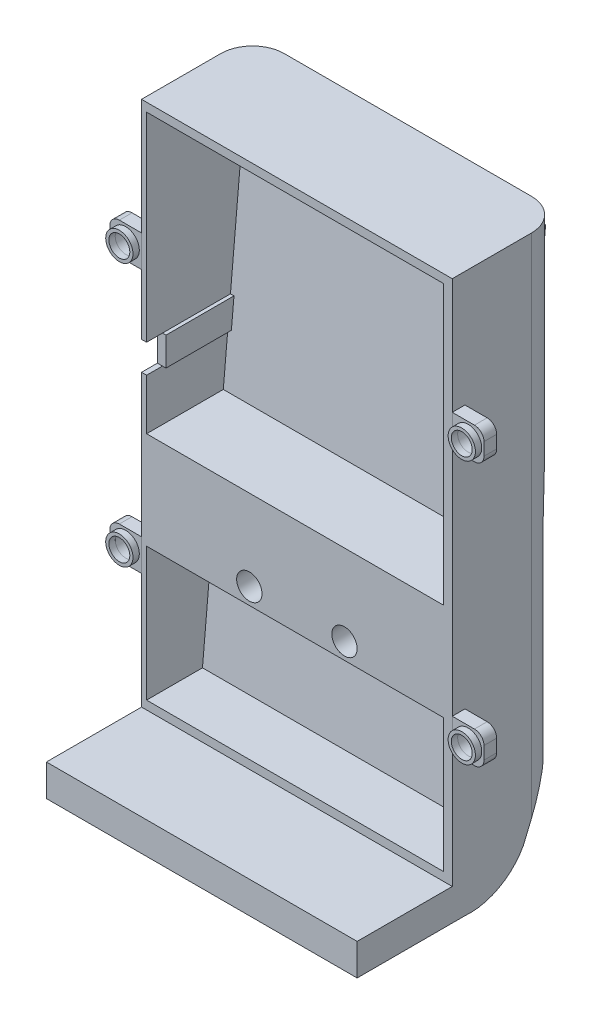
ISO-10303-21;
HEADER;
FILE_DESCRIPTION(('STEP AP214'),'2;1');
FILE_NAME('part.step','',(''),(''),'','','');
FILE_SCHEMA(('AUTOMOTIVE_DESIGN { 1 0 10303 214 1 1 1 1 }'));
ENDSEC;
DATA;
#1=APPLICATION_CONTEXT('core data for automotive mechanical design processes');
#2=APPLICATION_PROTOCOL_DEFINITION('international standard','automotive_design',2000,#1);
#3=PRODUCT_CONTEXT('',#1,'mechanical');
#4=PRODUCT('Part','Part','',(#3));
#5=PRODUCT_RELATED_PRODUCT_CATEGORY('part','',(#4));
#6=PRODUCT_DEFINITION_FORMATION('','',#4);
#7=PRODUCT_DEFINITION_CONTEXT('part definition',#1,'design');
#8=PRODUCT_DEFINITION('design','',#6,#7);
#9=PRODUCT_DEFINITION_SHAPE('','',#8);
#10=(LENGTH_UNIT() NAMED_UNIT(*) SI_UNIT(.MILLI.,.METRE.));
#11=(NAMED_UNIT(*) PLANE_ANGLE_UNIT() SI_UNIT($,.RADIAN.));
#12=(NAMED_UNIT(*) SI_UNIT($,.STERADIAN.) SOLID_ANGLE_UNIT());
#13=UNCERTAINTY_MEASURE_WITH_UNIT(LENGTH_MEASURE(1.E-05),#10,'distance_accuracy_value','');
#14=(GEOMETRIC_REPRESENTATION_CONTEXT(3) GLOBAL_UNCERTAINTY_ASSIGNED_CONTEXT((#13)) GLOBAL_UNIT_ASSIGNED_CONTEXT((#10,
#11,#12)) REPRESENTATION_CONTEXT('',''));
#15=CARTESIAN_POINT('',(0.,0.,0.));
#16=DIRECTION('',(0.,0.,1.));
#17=DIRECTION('',(1.,0.,0.));
#18=AXIS2_PLACEMENT_3D('',#15,#16,#17);
#19=CARTESIAN_POINT('',(-43.851767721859,56.4380132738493,12.));
#20=DIRECTION('',(0.,0.,-1.));
#21=DIRECTION('',(-1.,0.,0.));
#22=AXIS2_PLACEMENT_3D('',#19,#20,#21);
#23=PLANE('',#22);
#24=CARTESIAN_POINT('',(-43.851767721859,56.4380132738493,12.));
#25=DIRECTION('',(0.,0.,1.));
#26=DIRECTION('',(-1.,0.,0.));
#27=AXIS2_PLACEMENT_3D('',#24,#25,#26);
#28=CIRCLE('',#27,4.3);
#29=CARTESIAN_POINT('',(-48.151767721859,56.4380132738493,12.));
#30=VERTEX_POINT('',#29);
#31=EDGE_CURVE('E60',#30,#30,#28,.T.);
#32=ORIENTED_EDGE('',*,*,#31,.T.);
#33=EDGE_LOOP('',(#32));
#34=FACE_BOUND('',#33,.T.);
#35=CARTESIAN_POINT('',(-43.851767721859,56.4380132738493,12.));
#36=DIRECTION('',(0.,0.,1.));
#37=DIRECTION('',(1.,0.,0.));
#38=AXIS2_PLACEMENT_3D('',#35,#36,#37);
#39=CIRCLE('',#38,3.30000000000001);
#40=CARTESIAN_POINT('',(-40.551767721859,56.4380132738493,12.));
#41=VERTEX_POINT('',#40);
#42=EDGE_CURVE('E51',#41,#41,#39,.T.);
#43=ORIENTED_EDGE('',*,*,#42,.F.);
#44=EDGE_LOOP('',(#43));
#45=FACE_BOUND('',#44,.T.);
#46=ADVANCED_FACE('F47',(#34,#45),#23,.F.);
#47=CARTESIAN_POINT('',(-43.851767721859,56.4380132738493,10.));
#48=DIRECTION('',(0.,0.,-1.));
#49=DIRECTION('',(-1.,0.,0.));
#50=AXIS2_PLACEMENT_3D('',#47,#48,#49);
#51=PLANE('',#50);
#52=CARTESIAN_POINT('',(-43.851767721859,56.4380132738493,10.));
#53=DIRECTION('',(0.,0.,1.));
#54=DIRECTION('',(-1.,0.,0.));
#55=AXIS2_PLACEMENT_3D('',#52,#53,#54);
#56=CIRCLE('',#55,4.3);
#57=CARTESIAN_POINT('',(-48.151767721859,56.4380132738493,10.));
#58=VERTEX_POINT('',#57);
#59=EDGE_CURVE('E58',#58,#58,#56,.T.);
#60=ORIENTED_EDGE('',*,*,#59,.F.);
#61=EDGE_LOOP('',(#60));
#62=FACE_BOUND('',#61,.T.);
#63=CARTESIAN_POINT('',(-43.851767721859,56.4380132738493,10.));
#64=DIRECTION('',(0.,0.,1.));
#65=DIRECTION('',(1.,0.,0.));
#66=AXIS2_PLACEMENT_3D('',#63,#64,#65);
#67=CIRCLE('',#66,3.30000000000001);
#68=CARTESIAN_POINT('',(-40.551767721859,56.4380132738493,10.));
#69=VERTEX_POINT('',#68);
#70=EDGE_CURVE('E11',#69,#69,#67,.T.);
#71=ORIENTED_EDGE('',*,*,#70,.T.);
#72=EDGE_LOOP('',(#71));
#73=FACE_BOUND('',#72,.T.);
#74=ADVANCED_FACE('F68',(#62,#73),#51,.T.);
#75=CARTESIAN_POINT('',(-43.851767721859,56.4380132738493,12.));
#76=DIRECTION('',(0.,0.,-1.));
#77=DIRECTION('',(-1.,0.,0.));
#78=AXIS2_PLACEMENT_3D('',#75,#76,#77);
#79=CYLINDRICAL_SURFACE('',#78,4.3);
#80=ORIENTED_EDGE('',*,*,#31,.F.);
#81=EDGE_LOOP('',(#80));
#82=FACE_BOUND('',#81,.T.);
#83=ORIENTED_EDGE('',*,*,#59,.T.);
#84=EDGE_LOOP('',(#83));
#85=FACE_BOUND('',#84,.T.);
#86=ADVANCED_FACE('F66',(#82,#85),#79,.T.);
#87=CARTESIAN_POINT('',(-43.851767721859,56.4380132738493,12.));
#88=DIRECTION('',(0.,0.,-1.));
#89=DIRECTION('',(-1.,0.,0.));
#90=AXIS2_PLACEMENT_3D('',#87,#88,#89);
#91=CYLINDRICAL_SURFACE('',#90,3.30000000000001);
#92=ORIENTED_EDGE('',*,*,#42,.T.);
#93=EDGE_LOOP('',(#92));
#94=FACE_BOUND('',#93,.T.);
#95=ORIENTED_EDGE('',*,*,#70,.F.);
#96=EDGE_LOOP('',(#95));
#97=FACE_BOUND('',#96,.T.);
#98=ADVANCED_FACE('F49',(#94,#97),#91,.F.);
#99=CLOSED_SHELL('',(#46,#74,#86,#98));
#100=MANIFOLD_SOLID_BREP('B2',#99);
#101=CARTESIAN_POINT('',(64.1482322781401,56.4380132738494,12.));
#102=DIRECTION('',(0.,0.,1.));
#103=DIRECTION('',(1.,0.,0.));
#104=AXIS2_PLACEMENT_3D('',#101,#102,#103);
#105=PLANE('',#104);
#106=CARTESIAN_POINT('',(64.1482322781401,56.4380132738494,12.));
#107=DIRECTION('',(0.,0.,1.));
#108=DIRECTION('',(1.,0.,0.));
#109=AXIS2_PLACEMENT_3D('',#106,#107,#108);
#110=CIRCLE('',#109,4.30000000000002);
#111=CARTESIAN_POINT('',(68.4482322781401,56.4380132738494,12.));
#112=VERTEX_POINT('',#111);
#113=EDGE_CURVE('E129',#112,#112,#110,.T.);
#114=ORIENTED_EDGE('',*,*,#113,.T.);
#115=EDGE_LOOP('',(#114));
#116=FACE_BOUND('',#115,.T.);
#117=CARTESIAN_POINT('',(64.1482322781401,56.4380132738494,12.));
#118=DIRECTION('',(0.,0.,1.));
#119=DIRECTION('',(1.,0.,0.));
#120=AXIS2_PLACEMENT_3D('',#117,#118,#119);
#121=CIRCLE('',#120,3.30000000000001);
#122=CARTESIAN_POINT('',(67.4482322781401,56.4380132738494,12.));
#123=VERTEX_POINT('',#122);
#124=EDGE_CURVE('E120',#123,#123,#121,.T.);
#125=ORIENTED_EDGE('',*,*,#124,.F.);
#126=EDGE_LOOP('',(#125));
#127=FACE_BOUND('',#126,.T.);
#128=ADVANCED_FACE('F116',(#116,#127),#105,.T.);
#129=CARTESIAN_POINT('',(64.1482322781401,56.4380132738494,10.));
#130=DIRECTION('',(0.,0.,1.));
#131=DIRECTION('',(1.,0.,0.));
#132=AXIS2_PLACEMENT_3D('',#129,#130,#131);
#133=PLANE('',#132);
#134=CARTESIAN_POINT('',(64.1482322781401,56.4380132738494,10.));
#135=DIRECTION('',(0.,0.,1.));
#136=DIRECTION('',(1.,0.,0.));
#137=AXIS2_PLACEMENT_3D('',#134,#135,#136);
#138=CIRCLE('',#137,4.30000000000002);
#139=CARTESIAN_POINT('',(68.4482322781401,56.4380132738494,10.));
#140=VERTEX_POINT('',#139);
#141=EDGE_CURVE('E127',#140,#140,#138,.T.);
#142=ORIENTED_EDGE('',*,*,#141,.F.);
#143=EDGE_LOOP('',(#142));
#144=FACE_BOUND('',#143,.T.);
#145=CARTESIAN_POINT('',(64.1482322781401,56.4380132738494,10.));
#146=DIRECTION('',(0.,0.,1.));
#147=DIRECTION('',(1.,0.,0.));
#148=AXIS2_PLACEMENT_3D('',#145,#146,#147);
#149=CIRCLE('',#148,3.30000000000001);
#150=CARTESIAN_POINT('',(67.4482322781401,56.4380132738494,10.));
#151=VERTEX_POINT('',#150);
#152=EDGE_CURVE('E46',#151,#151,#149,.T.);
#153=ORIENTED_EDGE('',*,*,#152,.T.);
#154=EDGE_LOOP('',(#153));
#155=FACE_BOUND('',#154,.T.);
#156=ADVANCED_FACE('F137',(#144,#155),#133,.F.);
#157=CARTESIAN_POINT('',(64.1482322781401,56.4380132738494,12.));
#158=DIRECTION('',(0.,0.,-1.));
#159=DIRECTION('',(-1.,0.,0.));
#160=AXIS2_PLACEMENT_3D('',#157,#158,#159);
#161=CYLINDRICAL_SURFACE('',#160,4.30000000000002);
#162=ORIENTED_EDGE('',*,*,#113,.F.);
#163=EDGE_LOOP('',(#162));
#164=FACE_BOUND('',#163,.T.);
#165=ORIENTED_EDGE('',*,*,#141,.T.);
#166=EDGE_LOOP('',(#165));
#167=FACE_BOUND('',#166,.T.);
#168=ADVANCED_FACE('F135',(#164,#167),#161,.T.);
#169=CARTESIAN_POINT('',(64.1482322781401,56.4380132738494,12.));
#170=DIRECTION('',(0.,0.,-1.));
#171=DIRECTION('',(-1.,0.,0.));
#172=AXIS2_PLACEMENT_3D('',#169,#170,#171);
#173=CYLINDRICAL_SURFACE('',#172,3.30000000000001);
#174=ORIENTED_EDGE('',*,*,#124,.T.);
#175=EDGE_LOOP('',(#174));
#176=FACE_BOUND('',#175,.T.);
#177=ORIENTED_EDGE('',*,*,#152,.F.);
#178=EDGE_LOOP('',(#177));
#179=FACE_BOUND('',#178,.T.);
#180=ADVANCED_FACE('F118',(#176,#179),#173,.F.);
#181=CLOSED_SHELL('',(#128,#156,#168,#180));
#182=MANIFOLD_SOLID_BREP('B6',#181);
#183=CARTESIAN_POINT('',(64.1482322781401,-26.5000000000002,12.));
#184=DIRECTION('',(0.,0.,-1.));
#185=DIRECTION('',(-1.,0.,0.));
#186=AXIS2_PLACEMENT_3D('',#183,#184,#185);
#187=PLANE('',#186);
#188=CARTESIAN_POINT('',(64.1482322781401,-26.5000000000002,12.));
#189=DIRECTION('',(0.,0.,1.));
#190=DIRECTION('',(-1.,0.,0.));
#191=AXIS2_PLACEMENT_3D('',#188,#189,#190);
#192=CIRCLE('',#191,4.30000000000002);
#193=CARTESIAN_POINT('',(59.8482322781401,-26.5000000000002,12.));
#194=VERTEX_POINT('',#193);
#195=EDGE_CURVE('E198',#194,#194,#192,.T.);
#196=ORIENTED_EDGE('',*,*,#195,.T.);
#197=EDGE_LOOP('',(#196));
#198=FACE_BOUND('',#197,.T.);
#199=CARTESIAN_POINT('',(64.1482322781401,-26.5000000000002,12.));
#200=DIRECTION('',(0.,0.,1.));
#201=DIRECTION('',(1.,0.,0.));
#202=AXIS2_PLACEMENT_3D('',#199,#200,#201);
#203=CIRCLE('',#202,3.30000000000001);
#204=CARTESIAN_POINT('',(67.4482322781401,-26.5000000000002,12.));
#205=VERTEX_POINT('',#204);
#206=EDGE_CURVE('E189',#205,#205,#203,.T.);
#207=ORIENTED_EDGE('',*,*,#206,.F.);
#208=EDGE_LOOP('',(#207));
#209=FACE_BOUND('',#208,.T.);
#210=ADVANCED_FACE('F185',(#198,#209),#187,.F.);
#211=CARTESIAN_POINT('',(64.1482322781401,-26.5000000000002,10.));
#212=DIRECTION('',(0.,0.,-1.));
#213=DIRECTION('',(-1.,0.,0.));
#214=AXIS2_PLACEMENT_3D('',#211,#212,#213);
#215=PLANE('',#214);
#216=CARTESIAN_POINT('',(64.1482322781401,-26.5000000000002,10.));
#217=DIRECTION('',(0.,0.,1.));
#218=DIRECTION('',(-1.,0.,0.));
#219=AXIS2_PLACEMENT_3D('',#216,#217,#218);
#220=CIRCLE('',#219,4.30000000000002);
#221=CARTESIAN_POINT('',(59.8482322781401,-26.5000000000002,10.));
#222=VERTEX_POINT('',#221);
#223=EDGE_CURVE('E196',#222,#222,#220,.T.);
#224=ORIENTED_EDGE('',*,*,#223,.F.);
#225=EDGE_LOOP('',(#224));
#226=FACE_BOUND('',#225,.T.);
#227=CARTESIAN_POINT('',(64.1482322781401,-26.5000000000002,10.));
#228=DIRECTION('',(0.,0.,1.));
#229=DIRECTION('',(1.,0.,0.));
#230=AXIS2_PLACEMENT_3D('',#227,#228,#229);
#231=CIRCLE('',#230,3.30000000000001);
#232=CARTESIAN_POINT('',(67.4482322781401,-26.5000000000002,10.));
#233=VERTEX_POINT('',#232);
#234=EDGE_CURVE('E115',#233,#233,#231,.T.);
#235=ORIENTED_EDGE('',*,*,#234,.T.);
#236=EDGE_LOOP('',(#235));
#237=FACE_BOUND('',#236,.T.);
#238=ADVANCED_FACE('F206',(#226,#237),#215,.T.);
#239=CARTESIAN_POINT('',(64.1482322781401,-26.5000000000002,12.));
#240=DIRECTION('',(0.,0.,-1.));
#241=DIRECTION('',(-1.,0.,0.));
#242=AXIS2_PLACEMENT_3D('',#239,#240,#241);
#243=CYLINDRICAL_SURFACE('',#242,4.30000000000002);
#244=ORIENTED_EDGE('',*,*,#195,.F.);
#245=EDGE_LOOP('',(#244));
#246=FACE_BOUND('',#245,.T.);
#247=ORIENTED_EDGE('',*,*,#223,.T.);
#248=EDGE_LOOP('',(#247));
#249=FACE_BOUND('',#248,.T.);
#250=ADVANCED_FACE('F204',(#246,#249),#243,.T.);
#251=CARTESIAN_POINT('',(64.1482322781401,-26.5000000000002,12.));
#252=DIRECTION('',(0.,0.,-1.));
#253=DIRECTION('',(-1.,0.,0.));
#254=AXIS2_PLACEMENT_3D('',#251,#252,#253);
#255=CYLINDRICAL_SURFACE('',#254,3.30000000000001);
#256=ORIENTED_EDGE('',*,*,#206,.T.);
#257=EDGE_LOOP('',(#256));
#258=FACE_BOUND('',#257,.T.);
#259=ORIENTED_EDGE('',*,*,#234,.F.);
#260=EDGE_LOOP('',(#259));
#261=FACE_BOUND('',#260,.T.);
#262=ADVANCED_FACE('F187',(#258,#261),#255,.F.);
#263=CLOSED_SHELL('',(#210,#238,#250,#262));
#264=MANIFOLD_SOLID_BREP('B41',#263);
#265=CARTESIAN_POINT('',(-43.851767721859,-26.5000000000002,12.));
#266=DIRECTION('',(0.,0.,1.));
#267=DIRECTION('',(1.,0.,0.));
#268=AXIS2_PLACEMENT_3D('',#265,#266,#267);
#269=PLANE('',#268);
#270=CARTESIAN_POINT('',(-43.851767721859,-26.5000000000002,12.));
#271=DIRECTION('',(0.,0.,1.));
#272=DIRECTION('',(1.,0.,0.));
#273=AXIS2_PLACEMENT_3D('',#270,#271,#272);
#274=CIRCLE('',#273,4.3);
#275=CARTESIAN_POINT('',(-39.551767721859,-26.5000000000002,12.));
#276=VERTEX_POINT('',#275);
#277=EDGE_CURVE('E184',#276,#276,#274,.T.);
#278=ORIENTED_EDGE('',*,*,#277,.T.);
#279=EDGE_LOOP('',(#278));
#280=FACE_BOUND('',#279,.T.);
#281=CARTESIAN_POINT('',(-43.851767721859,-26.5000000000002,12.));
#282=DIRECTION('',(0.,0.,1.));
#283=DIRECTION('',(1.,0.,0.));
#284=AXIS2_PLACEMENT_3D('',#281,#282,#283);
#285=CIRCLE('',#284,3.3);
#286=CARTESIAN_POINT('',(-40.551767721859,-26.5000000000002,12.));
#287=VERTEX_POINT('',#286);
#288=EDGE_CURVE('E267',#287,#287,#285,.T.);
#289=ORIENTED_EDGE('',*,*,#288,.F.);
#290=EDGE_LOOP('',(#289));
#291=FACE_BOUND('',#290,.T.);
#292=ADVANCED_FACE('F256',(#280,#291),#269,.T.);
#293=CARTESIAN_POINT('',(-43.851767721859,-26.5000000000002,10.));
#294=DIRECTION('',(0.,0.,1.));
#295=DIRECTION('',(1.,0.,0.));
#296=AXIS2_PLACEMENT_3D('',#293,#294,#295);
#297=PLANE('',#296);
#298=CARTESIAN_POINT('',(-43.851767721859,-26.5000000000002,10.));
#299=DIRECTION('',(0.,0.,1.));
#300=DIRECTION('',(1.,0.,0.));
#301=AXIS2_PLACEMENT_3D('',#298,#299,#300);
#302=CIRCLE('',#301,4.3);
#303=CARTESIAN_POINT('',(-39.551767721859,-26.5000000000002,10.));
#304=VERTEX_POINT('',#303);
#305=EDGE_CURVE('E260',#304,#304,#302,.T.);
#306=ORIENTED_EDGE('',*,*,#305,.F.);
#307=EDGE_LOOP('',(#306));
#308=FACE_BOUND('',#307,.T.);
#309=CARTESIAN_POINT('',(-43.851767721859,-26.5000000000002,10.));
#310=DIRECTION('',(0.,0.,1.));
#311=DIRECTION('',(1.,0.,0.));
#312=AXIS2_PLACEMENT_3D('',#309,#310,#311);
#313=CIRCLE('',#312,3.3);
#314=CARTESIAN_POINT('',(-40.551767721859,-26.5000000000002,10.));
#315=VERTEX_POINT('',#314);
#316=EDGE_CURVE('E269',#315,#315,#313,.T.);
#317=ORIENTED_EDGE('',*,*,#316,.T.);
#318=EDGE_LOOP('',(#317));
#319=FACE_BOUND('',#318,.T.);
#320=ADVANCED_FACE('F279',(#308,#319),#297,.F.);
#321=CARTESIAN_POINT('',(-43.851767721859,-26.5000000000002,12.));
#322=DIRECTION('',(0.,0.,-1.));
#323=DIRECTION('',(-1.,0.,0.));
#324=AXIS2_PLACEMENT_3D('',#321,#322,#323);
#325=CYLINDRICAL_SURFACE('',#324,4.3);
#326=ORIENTED_EDGE('',*,*,#277,.F.);
#327=EDGE_LOOP('',(#326));
#328=FACE_BOUND('',#327,.T.);
#329=ORIENTED_EDGE('',*,*,#305,.T.);
#330=EDGE_LOOP('',(#329));
#331=FACE_BOUND('',#330,.T.);
#332=ADVANCED_FACE('F258',(#328,#331),#325,.T.);
#333=CARTESIAN_POINT('',(-43.851767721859,-26.5000000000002,12.));
#334=DIRECTION('',(0.,0.,-1.));
#335=DIRECTION('',(-1.,0.,0.));
#336=AXIS2_PLACEMENT_3D('',#333,#334,#335);
#337=CYLINDRICAL_SURFACE('',#336,3.3);
#338=ORIENTED_EDGE('',*,*,#288,.T.);
#339=EDGE_LOOP('',(#338));
#340=FACE_BOUND('',#339,.T.);
#341=ORIENTED_EDGE('',*,*,#316,.F.);
#342=EDGE_LOOP('',(#341));
#343=FACE_BOUND('',#342,.T.);
#344=ADVANCED_FACE('F275',(#340,#343),#337,.F.);
#345=CLOSED_SHELL('',(#292,#320,#332,#344));
#346=MANIFOLD_SOLID_BREP('B110',#345);
#347=CARTESIAN_POINT('',(59.148232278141,-21.4999999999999,6.));
#348=DIRECTION('',(-1.,0.,0.));
#349=DIRECTION('',(0.,-1.,0.));
#350=AXIS2_PLACEMENT_3D('',#347,#348,#349);
#351=PLANE('',#350);
#352=DIRECTION('',(0.,-1.,0.));
#353=VECTOR('',#352,1.);
#354=CARTESIAN_POINT('',(59.148232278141,-21.4999999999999,10.));
#355=LINE('',#354,#353);
#356=CARTESIAN_POINT('',(59.148232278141,-21.4999999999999,10.));
#357=VERTEX_POINT('',#356);
#358=CARTESIAN_POINT('',(59.148232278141,-31.4999999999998,10.));
#359=VERTEX_POINT('',#358);
#360=EDGE_CURVE('E388',#357,#359,#355,.T.);
#361=ORIENTED_EDGE('',*,*,#360,.F.);
#362=DIRECTION('',(0.,0.,1.));
#363=VECTOR('',#362,1.);
#364=CARTESIAN_POINT('',(59.148232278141,-21.4999999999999,6.));
#365=LINE('',#364,#363);
#366=CARTESIAN_POINT('',(59.148232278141,-21.4999999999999,6.));
#367=VERTEX_POINT('',#366);
#368=EDGE_CURVE('E394',#367,#357,#365,.T.);
#369=ORIENTED_EDGE('',*,*,#368,.F.);
#370=DIRECTION('',(0.,-1.,0.));
#371=VECTOR('',#370,1.);
#372=CARTESIAN_POINT('',(59.148232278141,-21.4999999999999,6.));
#373=LINE('',#372,#371);
#374=CARTESIAN_POINT('',(59.148232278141,-31.4999999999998,6.));
#375=VERTEX_POINT('',#374);
#376=EDGE_CURVE('E391',#367,#375,#373,.T.);
#377=ORIENTED_EDGE('',*,*,#376,.T.);
#378=DIRECTION('',(0.,0.,1.));
#379=VECTOR('',#378,1.);
#380=CARTESIAN_POINT('',(59.148232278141,-31.4999999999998,6.));
#381=LINE('',#380,#379);
#382=EDGE_CURVE('E400',#375,#359,#381,.T.);
#383=ORIENTED_EDGE('',*,*,#382,.T.);
#384=EDGE_LOOP('',(#361,#369,#377,#383));
#385=FACE_BOUND('',#384,.T.);
#386=ADVANCED_FACE('F327',(#385),#351,.T.);
#387=CARTESIAN_POINT('',(69.148232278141,-21.4999999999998,6.));
#388=DIRECTION('',(0.,1.,0.));
#389=DIRECTION('',(-1.,0.,0.));
#390=AXIS2_PLACEMENT_3D('',#387,#388,#389);
#391=PLANE('',#390);
#392=DIRECTION('',(-1.,0.,0.));
#393=VECTOR('',#392,1.);
#394=CARTESIAN_POINT('',(69.148232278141,-21.4999999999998,10.));
#395=LINE('',#394,#393);
#396=CARTESIAN_POINT('',(66.148232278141,-21.4999999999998,10.));
#397=VERTEX_POINT('',#396);
#398=EDGE_CURVE('E382',#397,#357,#395,.T.);
#399=ORIENTED_EDGE('',*,*,#398,.F.);
#400=DIRECTION('',(0.,0.,1.));
#401=VECTOR('',#400,1.);
#402=CARTESIAN_POINT('',(66.148232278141,-21.4999999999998,6.));
#403=LINE('',#402,#401);
#404=CARTESIAN_POINT('',(66.148232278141,-21.4999999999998,6.));
#405=VERTEX_POINT('',#404);
#406=EDGE_CURVE('E350',#397,#405,#403,.F.);
#407=ORIENTED_EDGE('',*,*,#406,.T.);
#408=DIRECTION('',(-1.,0.,0.));
#409=VECTOR('',#408,1.);
#410=CARTESIAN_POINT('',(69.148232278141,-21.4999999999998,6.));
#411=LINE('',#410,#409);
#412=EDGE_CURVE('E396',#405,#367,#411,.T.);
#413=ORIENTED_EDGE('',*,*,#412,.T.);
#414=ORIENTED_EDGE('',*,*,#368,.T.);
#415=EDGE_LOOP('',(#399,#407,#413,#414));
#416=FACE_BOUND('',#415,.T.);
#417=ADVANCED_FACE('F395',(#416),#391,.T.);
#418=CARTESIAN_POINT('',(69.148232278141,-31.4999999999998,6.));
#419=DIRECTION('',(1.,0.,0.));
#420=DIRECTION('',(0.,1.,0.));
#421=AXIS2_PLACEMENT_3D('',#418,#419,#420);
#422=PLANE('',#421);
#423=DIRECTION('',(0.,1.,0.));
#424=VECTOR('',#423,1.);
#425=CARTESIAN_POINT('',(69.148232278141,-31.4999999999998,6.));
#426=LINE('',#425,#424);
#427=CARTESIAN_POINT('',(69.148232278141,-28.4999999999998,6.));
#428=VERTEX_POINT('',#427);
#429=CARTESIAN_POINT('',(69.148232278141,-24.4999999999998,6.));
#430=VERTEX_POINT('',#429);
#431=EDGE_CURVE('E413',#428,#430,#426,.T.);
#432=ORIENTED_EDGE('',*,*,#431,.T.);
#433=DIRECTION('',(0.,0.,1.));
#434=VECTOR('',#433,1.);
#435=CARTESIAN_POINT('',(69.148232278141,-24.4999999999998,6.));
#436=LINE('',#435,#434);
#437=CARTESIAN_POINT('',(69.148232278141,-24.4999999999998,10.));
#438=VERTEX_POINT('',#437);
#439=EDGE_CURVE('E407',#430,#438,#436,.T.);
#440=ORIENTED_EDGE('',*,*,#439,.T.);
#441=DIRECTION('',(0.,1.,0.));
#442=VECTOR('',#441,1.);
#443=CARTESIAN_POINT('',(69.148232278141,-31.4999999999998,10.));
#444=LINE('',#443,#442);
#445=CARTESIAN_POINT('',(69.148232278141,-28.4999999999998,10.));
#446=VERTEX_POINT('',#445);
#447=EDGE_CURVE('E390',#446,#438,#444,.T.);
#448=ORIENTED_EDGE('',*,*,#447,.F.);
#449=DIRECTION('',(0.,0.,1.));
#450=VECTOR('',#449,1.);
#451=CARTESIAN_POINT('',(69.148232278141,-28.4999999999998,6.));
#452=LINE('',#451,#450);
#453=EDGE_CURVE('E404',#446,#428,#452,.F.);
#454=ORIENTED_EDGE('',*,*,#453,.T.);
#455=EDGE_LOOP('',(#432,#440,#448,#454));
#456=FACE_BOUND('',#455,.T.);
#457=ADVANCED_FACE('F433',(#456),#422,.T.);
#458=CARTESIAN_POINT('',(59.148232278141,-31.4999999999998,6.));
#459=DIRECTION('',(0.,-1.,0.));
#460=DIRECTION('',(1.,0.,0.));
#461=AXIS2_PLACEMENT_3D('',#458,#459,#460);
#462=PLANE('',#461);
#463=DIRECTION('',(1.,0.,0.));
#464=VECTOR('',#463,1.);
#465=CARTESIAN_POINT('',(59.148232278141,-31.4999999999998,6.));
#466=LINE('',#465,#464);
#467=CARTESIAN_POINT('',(66.148232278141,-31.4999999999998,6.));
#468=VERTEX_POINT('',#467);
#469=EDGE_CURVE('E416',#375,#468,#466,.T.);
#470=ORIENTED_EDGE('',*,*,#469,.T.);
#471=DIRECTION('',(0.,0.,1.));
#472=VECTOR('',#471,1.);
#473=CARTESIAN_POINT('',(66.148232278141,-31.4999999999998,6.));
#474=LINE('',#473,#472);
#475=CARTESIAN_POINT('',(66.148232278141,-31.4999999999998,10.));
#476=VERTEX_POINT('',#475);
#477=EDGE_CURVE('E254',#468,#476,#474,.T.);
#478=ORIENTED_EDGE('',*,*,#477,.T.);
#479=DIRECTION('',(1.,0.,0.));
#480=VECTOR('',#479,1.);
#481=CARTESIAN_POINT('',(59.148232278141,-31.4999999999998,10.));
#482=LINE('',#481,#480);
#483=EDGE_CURVE('E405',#359,#476,#482,.T.);
#484=ORIENTED_EDGE('',*,*,#483,.F.);
#485=ORIENTED_EDGE('',*,*,#382,.F.);
#486=EDGE_LOOP('',(#470,#478,#484,#485));
#487=FACE_BOUND('',#486,.T.);
#488=ADVANCED_FACE('F455',(#487),#462,.T.);
#489=CARTESIAN_POINT('',(0.,0.,6.));
#490=DIRECTION('',(0.,0.,1.));
#491=DIRECTION('',(1.,0.,0.));
#492=AXIS2_PLACEMENT_3D('',#489,#490,#491);
#493=PLANE('',#492);
#494=CARTESIAN_POINT('',(64.1482322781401,-26.5000000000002,6.));
#495=DIRECTION('',(0.,0.,-1.));
#496=DIRECTION('',(1.,0.,0.));
#497=AXIS2_PLACEMENT_3D('',#494,#495,#496);
#498=CIRCLE('',#497,3.3);
#499=CARTESIAN_POINT('',(67.4482322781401,-26.5000000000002,6.));
#500=VERTEX_POINT('',#499);
#501=EDGE_CURVE('E420',#500,#500,#498,.T.);
#502=ORIENTED_EDGE('',*,*,#501,.F.);
#503=EDGE_LOOP('',(#502));
#504=FACE_BOUND('',#503,.T.);
#505=ORIENTED_EDGE('',*,*,#412,.F.);
#506=CARTESIAN_POINT('',(66.148232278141,-24.4999999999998,6.));
#507=DIRECTION('',(0.,0.,1.));
#508=DIRECTION('',(1.,0.,0.));
#509=AXIS2_PLACEMENT_3D('',#506,#507,#508);
#510=CIRCLE('',#509,3.);
#511=EDGE_CURVE('E335',#405,#430,#510,.F.);
#512=ORIENTED_EDGE('',*,*,#511,.T.);
#513=ORIENTED_EDGE('',*,*,#431,.F.);
#514=CARTESIAN_POINT('',(66.148232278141,-28.4999999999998,6.));
#515=DIRECTION('',(0.,0.,1.));
#516=DIRECTION('',(1.,0.,0.));
#517=AXIS2_PLACEMENT_3D('',#514,#515,#516);
#518=CIRCLE('',#517,3.);
#519=EDGE_CURVE('E342',#428,#468,#518,.F.);
#520=ORIENTED_EDGE('',*,*,#519,.T.);
#521=ORIENTED_EDGE('',*,*,#469,.F.);
#522=ORIENTED_EDGE('',*,*,#376,.F.);
#523=EDGE_LOOP('',(#505,#512,#513,#520,#521,#522));
#524=FACE_BOUND('',#523,.T.);
#525=ADVANCED_FACE('F429',(#504,#524),#493,.F.);
#526=CARTESIAN_POINT('',(0.,0.,10.));
#527=DIRECTION('',(0.,0.,1.));
#528=DIRECTION('',(1.,0.,0.));
#529=AXIS2_PLACEMENT_3D('',#526,#527,#528);
#530=PLANE('',#529);
#531=CARTESIAN_POINT('',(64.1482322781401,-26.5000000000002,10.));
#532=DIRECTION('',(0.,0.,1.));
#533=DIRECTION('',(1.,0.,0.));
#534=AXIS2_PLACEMENT_3D('',#531,#532,#533);
#535=CIRCLE('',#534,3.3);
#536=CARTESIAN_POINT('',(67.4482322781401,-26.5000000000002,10.));
#537=VERTEX_POINT('',#536);
#538=EDGE_CURVE('E401',#537,#537,#535,.T.);
#539=ORIENTED_EDGE('',*,*,#538,.F.);
#540=EDGE_LOOP('',(#539));
#541=FACE_BOUND('',#540,.T.);
#542=ORIENTED_EDGE('',*,*,#447,.T.);
#543=CARTESIAN_POINT('',(66.148232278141,-24.4999999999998,10.));
#544=DIRECTION('',(0.,0.,1.));
#545=DIRECTION('',(1.,0.,0.));
#546=AXIS2_PLACEMENT_3D('',#543,#544,#545);
#547=CIRCLE('',#546,3.);
#548=EDGE_CURVE('E389',#438,#397,#547,.T.);
#549=ORIENTED_EDGE('',*,*,#548,.T.);
#550=ORIENTED_EDGE('',*,*,#398,.T.);
#551=ORIENTED_EDGE('',*,*,#360,.T.);
#552=ORIENTED_EDGE('',*,*,#483,.T.);
#553=CARTESIAN_POINT('',(66.148232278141,-28.4999999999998,10.));
#554=DIRECTION('',(0.,0.,1.));
#555=DIRECTION('',(1.,0.,0.));
#556=AXIS2_PLACEMENT_3D('',#553,#554,#555);
#557=CIRCLE('',#556,3.);
#558=EDGE_CURVE('E424',#476,#446,#557,.T.);
#559=ORIENTED_EDGE('',*,*,#558,.T.);
#560=EDGE_LOOP('',(#542,#549,#550,#551,#552,#559));
#561=FACE_BOUND('',#560,.T.);
#562=ADVANCED_FACE('F385',(#541,#561),#530,.T.);
#563=CARTESIAN_POINT('',(64.1482322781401,-26.5000000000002,16.));
#564=DIRECTION('',(0.,0.,-1.));
#565=DIRECTION('',(-1.,0.,0.));
#566=AXIS2_PLACEMENT_3D('',#563,#564,#565);
#567=CYLINDRICAL_SURFACE('',#566,3.3);
#568=ORIENTED_EDGE('',*,*,#538,.T.);
#569=EDGE_LOOP('',(#568));
#570=FACE_BOUND('',#569,.T.);
#571=ORIENTED_EDGE('',*,*,#501,.T.);
#572=EDGE_LOOP('',(#571));
#573=FACE_BOUND('',#572,.T.);
#574=ADVANCED_FACE('F438',(#570,#573),#567,.F.);
#575=CARTESIAN_POINT('',(66.148232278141,-24.4999999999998,6.));
#576=DIRECTION('',(0.,0.,1.));
#577=DIRECTION('',(1.,0.,0.));
#578=AXIS2_PLACEMENT_3D('',#575,#576,#577);
#579=CYLINDRICAL_SURFACE('',#578,3.);
#580=ORIENTED_EDGE('',*,*,#511,.F.);
#581=ORIENTED_EDGE('',*,*,#406,.F.);
#582=ORIENTED_EDGE('',*,*,#548,.F.);
#583=ORIENTED_EDGE('',*,*,#439,.F.);
#584=EDGE_LOOP('',(#580,#581,#582,#583));
#585=FACE_BOUND('',#584,.T.);
#586=ADVANCED_FACE('F436',(#585),#579,.T.);
#587=CARTESIAN_POINT('',(66.148232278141,-28.4999999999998,6.));
#588=DIRECTION('',(0.,0.,1.));
#589=DIRECTION('',(1.,0.,0.));
#590=AXIS2_PLACEMENT_3D('',#587,#588,#589);
#591=CYLINDRICAL_SURFACE('',#590,3.);
#592=ORIENTED_EDGE('',*,*,#519,.F.);
#593=ORIENTED_EDGE('',*,*,#453,.F.);
#594=ORIENTED_EDGE('',*,*,#558,.F.);
#595=ORIENTED_EDGE('',*,*,#477,.F.);
#596=EDGE_LOOP('',(#592,#593,#594,#595));
#597=FACE_BOUND('',#596,.T.);
#598=ADVANCED_FACE('F329',(#597),#591,.T.);
#599=CLOSED_SHELL('',(#386,#417,#457,#488,#525,#562,#574,#586,#598));
#600=MANIFOLD_SOLID_BREP('B179',#599);
#601=CARTESIAN_POINT('',(59.1482322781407,51.5000000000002,6.));
#602=DIRECTION('',(1.,0.,0.));
#603=DIRECTION('',(0.,1.,0.));
#604=AXIS2_PLACEMENT_3D('',#601,#602,#603);
#605=PLANE('',#604);
#606=DIRECTION('',(0.,1.,0.));
#607=VECTOR('',#606,1.);
#608=CARTESIAN_POINT('',(59.1482322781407,51.5000000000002,10.));
#609=LINE('',#608,#607);
#610=CARTESIAN_POINT('',(59.1482322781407,51.5000000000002,10.));
#611=VERTEX_POINT('',#610);
#612=CARTESIAN_POINT('',(59.1482322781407,61.5000000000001,10.));
#613=VERTEX_POINT('',#612);
#614=EDGE_CURVE('E589',#611,#613,#609,.T.);
#615=ORIENTED_EDGE('',*,*,#614,.T.);
#616=DIRECTION('',(0.,0.,1.));
#617=VECTOR('',#616,1.);
#618=CARTESIAN_POINT('',(59.1482322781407,61.5000000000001,6.));
#619=LINE('',#618,#617);
#620=CARTESIAN_POINT('',(59.1482322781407,61.5000000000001,6.));
#621=VERTEX_POINT('',#620);
#622=EDGE_CURVE('E597',#621,#613,#619,.T.);
#623=ORIENTED_EDGE('',*,*,#622,.F.);
#624=DIRECTION('',(0.,1.,0.));
#625=VECTOR('',#624,1.);
#626=CARTESIAN_POINT('',(59.1482322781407,51.5000000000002,6.));
#627=LINE('',#626,#625);
#628=CARTESIAN_POINT('',(59.1482322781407,51.5000000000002,6.));
#629=VERTEX_POINT('',#628);
#630=EDGE_CURVE('E591',#629,#621,#627,.T.);
#631=ORIENTED_EDGE('',*,*,#630,.F.);
#632=DIRECTION('',(0.,0.,1.));
#633=VECTOR('',#632,1.);
#634=CARTESIAN_POINT('',(59.1482322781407,51.5000000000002,6.));
#635=LINE('',#634,#633);
#636=EDGE_CURVE('E586',#629,#611,#635,.T.);
#637=ORIENTED_EDGE('',*,*,#636,.T.);
#638=EDGE_LOOP('',(#615,#623,#631,#637));
#639=FACE_BOUND('',#638,.T.);
#640=ADVANCED_FACE('F533',(#639),#605,.F.);
#641=CARTESIAN_POINT('',(69.1482322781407,61.5000000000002,6.));
#642=DIRECTION('',(0.,1.,0.));
#643=DIRECTION('',(-1.,0.,0.));
#644=AXIS2_PLACEMENT_3D('',#641,#642,#643);
#645=PLANE('',#644);
#646=DIRECTION('',(-1.,0.,0.));
#647=VECTOR('',#646,1.);
#648=CARTESIAN_POINT('',(69.1482322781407,61.5000000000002,10.));
#649=LINE('',#648,#647);
#650=CARTESIAN_POINT('',(66.1482322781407,61.5000000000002,10.));
#651=VERTEX_POINT('',#650);
#652=EDGE_CURVE('E603',#651,#613,#649,.T.);
#653=ORIENTED_EDGE('',*,*,#652,.F.);
#654=DIRECTION('',(0.,0.,1.));
#655=VECTOR('',#654,1.);
#656=CARTESIAN_POINT('',(66.1482322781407,61.5000000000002,6.));
#657=LINE('',#656,#655);
#658=CARTESIAN_POINT('',(66.1482322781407,61.5000000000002,6.));
#659=VERTEX_POINT('',#658);
#660=EDGE_CURVE('E325',#651,#659,#657,.F.);
#661=ORIENTED_EDGE('',*,*,#660,.T.);
#662=DIRECTION('',(-1.,0.,0.));
#663=VECTOR('',#662,1.);
#664=CARTESIAN_POINT('',(69.1482322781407,61.5000000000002,6.));
#665=LINE('',#664,#663);
#666=EDGE_CURVE('E614',#659,#621,#665,.T.);
#667=ORIENTED_EDGE('',*,*,#666,.T.);
#668=ORIENTED_EDGE('',*,*,#622,.T.);
#669=EDGE_LOOP('',(#653,#661,#667,#668));
#670=FACE_BOUND('',#669,.T.);
#671=ADVANCED_FACE('F647',(#670),#645,.T.);
#672=CARTESIAN_POINT('',(69.1482322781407,51.5000000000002,6.));
#673=DIRECTION('',(1.,0.,0.));
#674=DIRECTION('',(0.,1.,0.));
#675=AXIS2_PLACEMENT_3D('',#672,#673,#674);
#676=PLANE('',#675);
#677=DIRECTION('',(0.,1.,0.));
#678=VECTOR('',#677,1.);
#679=CARTESIAN_POINT('',(69.1482322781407,51.5000000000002,10.));
#680=LINE('',#679,#678);
#681=CARTESIAN_POINT('',(69.1482322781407,54.5000000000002,10.));
#682=VERTEX_POINT('',#681);
#683=CARTESIAN_POINT('',(69.1482322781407,58.5000000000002,10.));
#684=VERTEX_POINT('',#683);
#685=EDGE_CURVE('E610',#682,#684,#680,.T.);
#686=ORIENTED_EDGE('',*,*,#685,.F.);
#687=DIRECTION('',(0.,0.,1.));
#688=VECTOR('',#687,1.);
#689=CARTESIAN_POINT('',(69.1482322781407,54.5000000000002,6.));
#690=LINE('',#689,#688);
#691=CARTESIAN_POINT('',(69.1482322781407,54.5000000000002,6.));
#692=VERTEX_POINT('',#691);
#693=EDGE_CURVE('E635',#682,#692,#690,.F.);
#694=ORIENTED_EDGE('',*,*,#693,.T.);
#695=DIRECTION('',(0.,1.,0.));
#696=VECTOR('',#695,1.);
#697=CARTESIAN_POINT('',(69.1482322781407,51.5000000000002,6.));
#698=LINE('',#697,#696);
#699=CARTESIAN_POINT('',(69.1482322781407,58.5000000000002,6.));
#700=VERTEX_POINT('',#699);
#701=EDGE_CURVE('E620',#692,#700,#698,.T.);
#702=ORIENTED_EDGE('',*,*,#701,.T.);
#703=DIRECTION('',(0.,0.,1.));
#704=VECTOR('',#703,1.);
#705=CARTESIAN_POINT('',(69.1482322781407,58.5000000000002,6.));
#706=LINE('',#705,#704);
#707=EDGE_CURVE('E632',#700,#684,#706,.T.);
#708=ORIENTED_EDGE('',*,*,#707,.T.);
#709=EDGE_LOOP('',(#686,#694,#702,#708));
#710=FACE_BOUND('',#709,.T.);
#711=ADVANCED_FACE('F644',(#710),#676,.T.);
#712=CARTESIAN_POINT('',(59.1482322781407,51.5000000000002,6.));
#713=DIRECTION('',(0.,-1.,0.));
#714=DIRECTION('',(1.,0.,0.));
#715=AXIS2_PLACEMENT_3D('',#712,#713,#714);
#716=PLANE('',#715);
#717=DIRECTION('',(1.,0.,0.));
#718=VECTOR('',#717,1.);
#719=CARTESIAN_POINT('',(59.1482322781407,51.5000000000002,6.));
#720=LINE('',#719,#718);
#721=CARTESIAN_POINT('',(66.1482322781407,51.5000000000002,6.));
#722=VERTEX_POINT('',#721);
#723=EDGE_CURVE('E596',#629,#722,#720,.T.);
#724=ORIENTED_EDGE('',*,*,#723,.T.);
#725=DIRECTION('',(0.,0.,1.));
#726=VECTOR('',#725,1.);
#727=CARTESIAN_POINT('',(66.1482322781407,51.5000000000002,6.));
#728=LINE('',#727,#726);
#729=CARTESIAN_POINT('',(66.1482322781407,51.5000000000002,10.));
#730=VERTEX_POINT('',#729);
#731=EDGE_CURVE('E605',#722,#730,#728,.T.);
#732=ORIENTED_EDGE('',*,*,#731,.T.);
#733=DIRECTION('',(1.,0.,0.));
#734=VECTOR('',#733,1.);
#735=CARTESIAN_POINT('',(59.1482322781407,51.5000000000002,10.));
#736=LINE('',#735,#734);
#737=EDGE_CURVE('E602',#611,#730,#736,.T.);
#738=ORIENTED_EDGE('',*,*,#737,.F.);
#739=ORIENTED_EDGE('',*,*,#636,.F.);
#740=EDGE_LOOP('',(#724,#732,#738,#739));
#741=FACE_BOUND('',#740,.T.);
#742=ADVANCED_FACE('F608',(#741),#716,.T.);
#743=CARTESIAN_POINT('',(0.,0.,6.));
#744=DIRECTION('',(0.,0.,1.));
#745=DIRECTION('',(1.,0.,0.));
#746=AXIS2_PLACEMENT_3D('',#743,#744,#745);
#747=PLANE('',#746);
#748=CARTESIAN_POINT('',(64.1482322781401,56.4380132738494,6.));
#749=DIRECTION('',(0.,0.,-1.));
#750=DIRECTION('',(-1.,0.,0.));
#751=AXIS2_PLACEMENT_3D('',#748,#749,#750);
#752=CIRCLE('',#751,3.30000000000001);
#753=CARTESIAN_POINT('',(60.8482322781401,56.4380132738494,6.));
#754=VERTEX_POINT('',#753);
#755=EDGE_CURVE('E626',#754,#754,#752,.T.);
#756=ORIENTED_EDGE('',*,*,#755,.F.);
#757=EDGE_LOOP('',(#756));
#758=FACE_BOUND('',#757,.T.);
#759=ORIENTED_EDGE('',*,*,#701,.F.);
#760=CARTESIAN_POINT('',(66.1482322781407,54.5000000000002,6.));
#761=DIRECTION('',(0.,0.,1.));
#762=DIRECTION('',(1.,0.,0.));
#763=AXIS2_PLACEMENT_3D('',#760,#761,#762);
#764=CIRCLE('',#763,3.);
#765=EDGE_CURVE('E541',#692,#722,#764,.F.);
#766=ORIENTED_EDGE('',*,*,#765,.T.);
#767=ORIENTED_EDGE('',*,*,#723,.F.);
#768=ORIENTED_EDGE('',*,*,#630,.T.);
#769=ORIENTED_EDGE('',*,*,#666,.F.);
#770=CARTESIAN_POINT('',(66.1482322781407,58.5000000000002,6.));
#771=DIRECTION('',(0.,0.,1.));
#772=DIRECTION('',(1.,0.,0.));
#773=AXIS2_PLACEMENT_3D('',#770,#771,#772);
#774=CIRCLE('',#773,3.);
#775=EDGE_CURVE('E553',#659,#700,#774,.F.);
#776=ORIENTED_EDGE('',*,*,#775,.T.);
#777=EDGE_LOOP('',(#759,#766,#767,#768,#769,#776));
#778=FACE_BOUND('',#777,.T.);
#779=ADVANCED_FACE('F638',(#758,#778),#747,.F.);
#780=CARTESIAN_POINT('',(0.,0.,10.));
#781=DIRECTION('',(0.,0.,1.));
#782=DIRECTION('',(1.,0.,0.));
#783=AXIS2_PLACEMENT_3D('',#780,#781,#782);
#784=PLANE('',#783);
#785=CARTESIAN_POINT('',(64.1482322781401,56.4380132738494,10.));
#786=DIRECTION('',(0.,0.,1.));
#787=DIRECTION('',(1.,0.,0.));
#788=AXIS2_PLACEMENT_3D('',#785,#786,#787);
#789=CIRCLE('',#788,3.30000000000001);
#790=CARTESIAN_POINT('',(67.4482322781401,56.4380132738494,10.));
#791=VERTEX_POINT('',#790);
#792=EDGE_CURVE('E623',#791,#791,#789,.T.);
#793=ORIENTED_EDGE('',*,*,#792,.F.);
#794=EDGE_LOOP('',(#793));
#795=FACE_BOUND('',#794,.T.);
#796=ORIENTED_EDGE('',*,*,#737,.T.);
#797=CARTESIAN_POINT('',(66.1482322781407,54.5000000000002,10.));
#798=DIRECTION('',(0.,0.,1.));
#799=DIRECTION('',(1.,0.,0.));
#800=AXIS2_PLACEMENT_3D('',#797,#798,#799);
#801=CIRCLE('',#800,3.);
#802=EDGE_CURVE('E630',#730,#682,#801,.T.);
#803=ORIENTED_EDGE('',*,*,#802,.T.);
#804=ORIENTED_EDGE('',*,*,#685,.T.);
#805=CARTESIAN_POINT('',(66.1482322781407,58.5000000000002,10.));
#806=DIRECTION('',(0.,0.,1.));
#807=DIRECTION('',(1.,0.,0.));
#808=AXIS2_PLACEMENT_3D('',#805,#806,#807);
#809=CIRCLE('',#808,3.);
#810=EDGE_CURVE('E628',#684,#651,#809,.T.);
#811=ORIENTED_EDGE('',*,*,#810,.T.);
#812=ORIENTED_EDGE('',*,*,#652,.T.);
#813=ORIENTED_EDGE('',*,*,#614,.F.);
#814=EDGE_LOOP('',(#796,#803,#804,#811,#812,#813));
#815=FACE_BOUND('',#814,.T.);
#816=ADVANCED_FACE('F601',(#795,#815),#784,.T.);
#817=CARTESIAN_POINT('',(64.1482322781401,56.4380132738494,16.));
#818=DIRECTION('',(0.,0.,-1.));
#819=DIRECTION('',(-1.,0.,0.));
#820=AXIS2_PLACEMENT_3D('',#817,#818,#819);
#821=CYLINDRICAL_SURFACE('',#820,3.30000000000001);
#822=ORIENTED_EDGE('',*,*,#792,.T.);
#823=EDGE_LOOP('',(#822));
#824=FACE_BOUND('',#823,.T.);
#825=ORIENTED_EDGE('',*,*,#755,.T.);
#826=EDGE_LOOP('',(#825));
#827=FACE_BOUND('',#826,.T.);
#828=ADVANCED_FACE('F652',(#824,#827),#821,.F.);
#829=CARTESIAN_POINT('',(66.1482322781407,54.5000000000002,6.));
#830=DIRECTION('',(0.,0.,1.));
#831=DIRECTION('',(1.,0.,0.));
#832=AXIS2_PLACEMENT_3D('',#829,#830,#831);
#833=CYLINDRICAL_SURFACE('',#832,3.);
#834=ORIENTED_EDGE('',*,*,#765,.F.);
#835=ORIENTED_EDGE('',*,*,#693,.F.);
#836=ORIENTED_EDGE('',*,*,#802,.F.);
#837=ORIENTED_EDGE('',*,*,#731,.F.);
#838=EDGE_LOOP('',(#834,#835,#836,#837));
#839=FACE_BOUND('',#838,.T.);
#840=ADVANCED_FACE('F641',(#839),#833,.T.);
#841=CARTESIAN_POINT('',(66.1482322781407,58.5000000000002,6.));
#842=DIRECTION('',(0.,0.,1.));
#843=DIRECTION('',(1.,0.,0.));
#844=AXIS2_PLACEMENT_3D('',#841,#842,#843);
#845=CYLINDRICAL_SURFACE('',#844,3.);
#846=ORIENTED_EDGE('',*,*,#775,.F.);
#847=ORIENTED_EDGE('',*,*,#660,.F.);
#848=ORIENTED_EDGE('',*,*,#810,.F.);
#849=ORIENTED_EDGE('',*,*,#707,.F.);
#850=EDGE_LOOP('',(#846,#847,#848,#849));
#851=FACE_BOUND('',#850,.T.);
#852=ADVANCED_FACE('F535',(#851),#845,.T.);
#853=CLOSED_SHELL('',(#640,#671,#711,#742,#779,#816,#828,#840,#852));
#854=MANIFOLD_SOLID_BREP('B248',#853);
#855=CARTESIAN_POINT('',(-38.8517677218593,51.4999999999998,6.));
#856=DIRECTION('',(0.,1.,0.));
#857=DIRECTION('',(-1.,0.,0.));
#858=AXIS2_PLACEMENT_3D('',#855,#856,#857);
#859=PLANE('',#858);
#860=DIRECTION('',(-1.,0.,0.));
#861=VECTOR('',#860,1.);
#862=CARTESIAN_POINT('',(-38.8517677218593,51.4999999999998,10.));
#863=LINE('',#862,#861);
#864=CARTESIAN_POINT('',(-38.8517677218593,51.4999999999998,10.));
#865=VERTEX_POINT('',#864);
#866=CARTESIAN_POINT('',(-45.8517677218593,51.4999999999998,10.));
#867=VERTEX_POINT('',#866);
#868=EDGE_CURVE('E794',#865,#867,#863,.T.);
#869=ORIENTED_EDGE('',*,*,#868,.T.);
#870=DIRECTION('',(0.,0.,1.));
#871=VECTOR('',#870,1.);
#872=CARTESIAN_POINT('',(-45.8517677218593,51.4999999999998,6.));
#873=LINE('',#872,#871);
#874=CARTESIAN_POINT('',(-45.8517677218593,51.4999999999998,6.));
#875=VERTEX_POINT('',#874);
#876=EDGE_CURVE('E762',#867,#875,#873,.F.);
#877=ORIENTED_EDGE('',*,*,#876,.T.);
#878=DIRECTION('',(-1.,0.,0.));
#879=VECTOR('',#878,1.);
#880=CARTESIAN_POINT('',(-38.8517677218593,51.4999999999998,6.));
#881=LINE('',#880,#879);
#882=CARTESIAN_POINT('',(-38.8517677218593,51.4999999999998,6.));
#883=VERTEX_POINT('',#882);
#884=EDGE_CURVE('E795',#883,#875,#881,.T.);
#885=ORIENTED_EDGE('',*,*,#884,.F.);
#886=DIRECTION('',(0.,0.,1.));
#887=VECTOR('',#886,1.);
#888=CARTESIAN_POINT('',(-38.8517677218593,51.4999999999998,6.));
#889=LINE('',#888,#887);
#890=EDGE_CURVE('E792',#883,#865,#889,.T.);
#891=ORIENTED_EDGE('',*,*,#890,.T.);
#892=EDGE_LOOP('',(#869,#877,#885,#891));
#893=FACE_BOUND('',#892,.T.);
#894=ADVANCED_FACE('F739',(#893),#859,.F.);
#895=CARTESIAN_POINT('',(-48.8517677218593,51.4999999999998,6.));
#896=DIRECTION('',(1.,0.,0.));
#897=DIRECTION('',(0.,1.,0.));
#898=AXIS2_PLACEMENT_3D('',#895,#896,#897);
#899=PLANE('',#898);
#900=DIRECTION('',(0.,1.,0.));
#901=VECTOR('',#900,1.);
#902=CARTESIAN_POINT('',(-48.8517677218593,51.4999999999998,6.));
#903=LINE('',#902,#901);
#904=CARTESIAN_POINT('',(-48.8517677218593,54.4999999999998,6.));
#905=VERTEX_POINT('',#904);
#906=CARTESIAN_POINT('',(-48.8517677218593,58.4999999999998,6.));
#907=VERTEX_POINT('',#906);
#908=EDGE_CURVE('E819',#905,#907,#903,.T.);
#909=ORIENTED_EDGE('',*,*,#908,.F.);
#910=DIRECTION('',(0.,0.,1.));
#911=VECTOR('',#910,1.);
#912=CARTESIAN_POINT('',(-48.8517677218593,54.4999999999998,6.));
#913=LINE('',#912,#911);
#914=CARTESIAN_POINT('',(-48.8517677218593,54.4999999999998,10.));
#915=VERTEX_POINT('',#914);
#916=EDGE_CURVE('E834',#905,#915,#913,.T.);
#917=ORIENTED_EDGE('',*,*,#916,.T.);
#918=DIRECTION('',(0.,1.,0.));
#919=VECTOR('',#918,1.);
#920=CARTESIAN_POINT('',(-48.8517677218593,51.4999999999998,10.));
#921=LINE('',#920,#919);
#922=CARTESIAN_POINT('',(-48.8517677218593,58.4999999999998,10.));
#923=VERTEX_POINT('',#922);
#924=EDGE_CURVE('E811',#915,#923,#921,.T.);
#925=ORIENTED_EDGE('',*,*,#924,.T.);
#926=DIRECTION('',(0.,0.,1.));
#927=VECTOR('',#926,1.);
#928=CARTESIAN_POINT('',(-48.8517677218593,58.4999999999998,6.));
#929=LINE('',#928,#927);
#930=EDGE_CURVE('E810',#923,#907,#929,.F.);
#931=ORIENTED_EDGE('',*,*,#930,.T.);
#932=EDGE_LOOP('',(#909,#917,#925,#931));
#933=FACE_BOUND('',#932,.T.);
#934=ADVANCED_FACE('F847',(#933),#899,.F.);
#935=CARTESIAN_POINT('',(-48.8517677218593,61.4999999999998,6.));
#936=DIRECTION('',(0.,-1.,0.));
#937=DIRECTION('',(1.,0.,0.));
#938=AXIS2_PLACEMENT_3D('',#935,#936,#937);
#939=PLANE('',#938);
#940=DIRECTION('',(1.,0.,0.));
#941=VECTOR('',#940,1.);
#942=CARTESIAN_POINT('',(-48.8517677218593,61.4999999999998,6.));
#943=LINE('',#942,#941);
#944=CARTESIAN_POINT('',(-45.8517677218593,61.4999999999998,6.));
#945=VERTEX_POINT('',#944);
#946=CARTESIAN_POINT('',(-38.8517677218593,61.4999999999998,6.));
#947=VERTEX_POINT('',#946);
#948=EDGE_CURVE('E826',#945,#947,#943,.T.);
#949=ORIENTED_EDGE('',*,*,#948,.F.);
#950=DIRECTION('',(0.,0.,1.));
#951=VECTOR('',#950,1.);
#952=CARTESIAN_POINT('',(-45.8517677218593,61.4999999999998,6.));
#953=LINE('',#952,#951);
#954=CARTESIAN_POINT('',(-45.8517677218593,61.4999999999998,10.));
#955=VERTEX_POINT('',#954);
#956=EDGE_CURVE('E531',#945,#955,#953,.T.);
#957=ORIENTED_EDGE('',*,*,#956,.T.);
#958=DIRECTION('',(1.,0.,0.));
#959=VECTOR('',#958,1.);
#960=CARTESIAN_POINT('',(-48.8517677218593,61.4999999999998,10.));
#961=LINE('',#960,#959);
#962=CARTESIAN_POINT('',(-38.8517677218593,61.4999999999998,10.));
#963=VERTEX_POINT('',#962);
#964=EDGE_CURVE('E816',#955,#963,#961,.T.);
#965=ORIENTED_EDGE('',*,*,#964,.T.);
#966=DIRECTION('',(0.,0.,1.));
#967=VECTOR('',#966,1.);
#968=CARTESIAN_POINT('',(-38.8517677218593,61.4999999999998,6.));
#969=LINE('',#968,#967);
#970=EDGE_CURVE('E801',#947,#963,#969,.T.);
#971=ORIENTED_EDGE('',*,*,#970,.F.);
#972=EDGE_LOOP('',(#949,#957,#965,#971));
#973=FACE_BOUND('',#972,.T.);
#974=ADVANCED_FACE('F866',(#973),#939,.F.);
#975=CARTESIAN_POINT('',(-38.8517677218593,51.4999999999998,6.));
#976=DIRECTION('',(1.,0.,0.));
#977=DIRECTION('',(0.,1.,0.));
#978=AXIS2_PLACEMENT_3D('',#975,#976,#977);
#979=PLANE('',#978);
#980=DIRECTION('',(0.,1.,0.));
#981=VECTOR('',#980,1.);
#982=CARTESIAN_POINT('',(-38.8517677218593,51.4999999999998,10.));
#983=LINE('',#982,#981);
#984=EDGE_CURVE('E808',#865,#963,#983,.T.);
#985=ORIENTED_EDGE('',*,*,#984,.F.);
#986=ORIENTED_EDGE('',*,*,#890,.F.);
#987=DIRECTION('',(0.,1.,0.));
#988=VECTOR('',#987,1.);
#989=CARTESIAN_POINT('',(-38.8517677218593,51.4999999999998,6.));
#990=LINE('',#989,#988);
#991=EDGE_CURVE('E800',#883,#947,#990,.T.);
#992=ORIENTED_EDGE('',*,*,#991,.T.);
#993=ORIENTED_EDGE('',*,*,#970,.T.);
#994=EDGE_LOOP('',(#985,#986,#992,#993));
#995=FACE_BOUND('',#994,.T.);
#996=ADVANCED_FACE('F814',(#995),#979,.T.);
#997=CARTESIAN_POINT('',(0.,0.,6.));
#998=DIRECTION('',(0.,0.,-1.));
#999=DIRECTION('',(-1.,0.,0.));
#1000=AXIS2_PLACEMENT_3D('',#997,#998,#999);
#1001=PLANE('',#1000);
#1002=CARTESIAN_POINT('',(-43.851767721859,56.4380132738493,6.));
#1003=DIRECTION('',(0.,0.,-1.));
#1004=DIRECTION('',(1.,0.,0.));
#1005=AXIS2_PLACEMENT_3D('',#1002,#1003,#1004);
#1006=CIRCLE('',#1005,3.3);
#1007=CARTESIAN_POINT('',(-40.551767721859,56.4380132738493,6.));
#1008=VERTEX_POINT('',#1007);
#1009=EDGE_CURVE('E832',#1008,#1008,#1006,.T.);
#1010=ORIENTED_EDGE('',*,*,#1009,.F.);
#1011=EDGE_LOOP('',(#1010));
#1012=FACE_BOUND('',#1011,.T.);
#1013=ORIENTED_EDGE('',*,*,#884,.T.);
#1014=CARTESIAN_POINT('',(-45.8517677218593,54.4999999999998,6.));
#1015=DIRECTION('',(0.,0.,-1.));
#1016=DIRECTION('',(-1.,0.,0.));
#1017=AXIS2_PLACEMENT_3D('',#1014,#1015,#1016);
#1018=CIRCLE('',#1017,3.);
#1019=EDGE_CURVE('E747',#875,#905,#1018,.T.);
#1020=ORIENTED_EDGE('',*,*,#1019,.T.);
#1021=ORIENTED_EDGE('',*,*,#908,.T.);
#1022=CARTESIAN_POINT('',(-45.8517677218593,58.4999999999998,6.));
#1023=DIRECTION('',(0.,0.,-1.));
#1024=DIRECTION('',(-1.,0.,0.));
#1025=AXIS2_PLACEMENT_3D('',#1022,#1023,#1024);
#1026=CIRCLE('',#1025,3.);
#1027=EDGE_CURVE('E754',#907,#945,#1026,.T.);
#1028=ORIENTED_EDGE('',*,*,#1027,.T.);
#1029=ORIENTED_EDGE('',*,*,#948,.T.);
#1030=ORIENTED_EDGE('',*,*,#991,.F.);
#1031=EDGE_LOOP('',(#1013,#1020,#1021,#1028,#1029,#1030));
#1032=FACE_BOUND('',#1031,.T.);
#1033=ADVANCED_FACE('F843',(#1012,#1032),#1001,.T.);
#1034=CARTESIAN_POINT('',(0.,0.,10.));
#1035=DIRECTION('',(0.,0.,-1.));
#1036=DIRECTION('',(-1.,0.,0.));
#1037=AXIS2_PLACEMENT_3D('',#1034,#1035,#1036);
#1038=PLANE('',#1037);
#1039=CARTESIAN_POINT('',(-43.851767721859,56.4380132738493,10.));
#1040=DIRECTION('',(0.,0.,-1.));
#1041=DIRECTION('',(-1.,0.,0.));
#1042=AXIS2_PLACEMENT_3D('',#1039,#1040,#1041);
#1043=CIRCLE('',#1042,3.3);
#1044=CARTESIAN_POINT('',(-47.151767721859,56.4380132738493,10.));
#1045=VERTEX_POINT('',#1044);
#1046=EDGE_CURVE('E829',#1045,#1045,#1043,.T.);
#1047=ORIENTED_EDGE('',*,*,#1046,.T.);
#1048=EDGE_LOOP('',(#1047));
#1049=FACE_BOUND('',#1048,.T.);
#1050=ORIENTED_EDGE('',*,*,#924,.F.);
#1051=CARTESIAN_POINT('',(-45.8517677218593,54.4999999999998,10.));
#1052=DIRECTION('',(0.,0.,-1.));
#1053=DIRECTION('',(-1.,0.,0.));
#1054=AXIS2_PLACEMENT_3D('',#1051,#1052,#1053);
#1055=CIRCLE('',#1054,3.);
#1056=EDGE_CURVE('E809',#915,#867,#1055,.F.);
#1057=ORIENTED_EDGE('',*,*,#1056,.T.);
#1058=ORIENTED_EDGE('',*,*,#868,.F.);
#1059=ORIENTED_EDGE('',*,*,#984,.T.);
#1060=ORIENTED_EDGE('',*,*,#964,.F.);
#1061=CARTESIAN_POINT('',(-45.8517677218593,58.4999999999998,10.));
#1062=DIRECTION('',(0.,0.,-1.));
#1063=DIRECTION('',(-1.,0.,0.));
#1064=AXIS2_PLACEMENT_3D('',#1061,#1062,#1063);
#1065=CIRCLE('',#1064,3.);
#1066=EDGE_CURVE('E837',#955,#923,#1065,.F.);
#1067=ORIENTED_EDGE('',*,*,#1066,.T.);
#1068=EDGE_LOOP('',(#1050,#1057,#1058,#1059,#1060,#1067));
#1069=FACE_BOUND('',#1068,.T.);
#1070=ADVANCED_FACE('F806',(#1049,#1069),#1038,.F.);
#1071=CARTESIAN_POINT('',(-43.851767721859,56.4380132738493,16.));
#1072=DIRECTION('',(0.,0.,-1.));
#1073=DIRECTION('',(-1.,0.,0.));
#1074=AXIS2_PLACEMENT_3D('',#1071,#1072,#1073);
#1075=CYLINDRICAL_SURFACE('',#1074,3.3);
#1076=ORIENTED_EDGE('',*,*,#1009,.T.);
#1077=EDGE_LOOP('',(#1076));
#1078=FACE_BOUND('',#1077,.T.);
#1079=ORIENTED_EDGE('',*,*,#1046,.F.);
#1080=EDGE_LOOP('',(#1079));
#1081=FACE_BOUND('',#1080,.T.);
#1082=ADVANCED_FACE('F851',(#1078,#1081),#1075,.F.);
#1083=CARTESIAN_POINT('',(-45.8517677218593,54.4999999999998,6.));
#1084=DIRECTION('',(0.,0.,1.));
#1085=DIRECTION('',(1.,0.,0.));
#1086=AXIS2_PLACEMENT_3D('',#1083,#1084,#1085);
#1087=CYLINDRICAL_SURFACE('',#1086,3.);
#1088=ORIENTED_EDGE('',*,*,#1019,.F.);
#1089=ORIENTED_EDGE('',*,*,#876,.F.);
#1090=ORIENTED_EDGE('',*,*,#1056,.F.);
#1091=ORIENTED_EDGE('',*,*,#916,.F.);
#1092=EDGE_LOOP('',(#1088,#1089,#1090,#1091));
#1093=FACE_BOUND('',#1092,.T.);
#1094=ADVANCED_FACE('F849',(#1093),#1087,.T.);
#1095=CARTESIAN_POINT('',(-45.8517677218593,58.4999999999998,6.));
#1096=DIRECTION('',(0.,0.,1.));
#1097=DIRECTION('',(1.,0.,0.));
#1098=AXIS2_PLACEMENT_3D('',#1095,#1096,#1097);
#1099=CYLINDRICAL_SURFACE('',#1098,3.);
#1100=ORIENTED_EDGE('',*,*,#1027,.F.);
#1101=ORIENTED_EDGE('',*,*,#930,.F.);
#1102=ORIENTED_EDGE('',*,*,#1066,.F.);
#1103=ORIENTED_EDGE('',*,*,#956,.F.);
#1104=EDGE_LOOP('',(#1100,#1101,#1102,#1103));
#1105=FACE_BOUND('',#1104,.T.);
#1106=ADVANCED_FACE('F741',(#1105),#1099,.T.);
#1107=CLOSED_SHELL('',(#894,#934,#974,#996,#1033,#1070,#1082,#1094,#1106));
#1108=MANIFOLD_SOLID_BREP('B319',#1107);
#1109=CARTESIAN_POINT('',(-38.851767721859,-31.5000000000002,6.));
#1110=DIRECTION('',(0.,1.,0.));
#1111=DIRECTION('',(-1.,0.,0.));
#1112=AXIS2_PLACEMENT_3D('',#1109,#1110,#1111);
#1113=PLANE('',#1112);
#1114=DIRECTION('',(-1.,0.,0.));
#1115=VECTOR('',#1114,1.);
#1116=CARTESIAN_POINT('',(-38.851767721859,-31.5000000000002,10.));
#1117=LINE('',#1116,#1115);
#1118=CARTESIAN_POINT('',(-38.851767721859,-31.5000000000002,10.));
#1119=VERTEX_POINT('',#1118);
#1120=CARTESIAN_POINT('',(-45.851767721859,-31.5000000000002,10.));
#1121=VERTEX_POINT('',#1120);
#1122=EDGE_CURVE('E1024',#1119,#1121,#1117,.T.);
#1123=ORIENTED_EDGE('',*,*,#1122,.T.);
#1124=DIRECTION('',(0.,0.,1.));
#1125=VECTOR('',#1124,1.);
#1126=CARTESIAN_POINT('',(-45.851767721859,-31.5000000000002,6.));
#1127=LINE('',#1126,#1125);
#1128=CARTESIAN_POINT('',(-45.851767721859,-31.5000000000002,6.));
#1129=VERTEX_POINT('',#1128);
#1130=EDGE_CURVE('E968',#1121,#1129,#1127,.F.);
#1131=ORIENTED_EDGE('',*,*,#1130,.T.);
#1132=DIRECTION('',(-1.,0.,0.));
#1133=VECTOR('',#1132,1.);
#1134=CARTESIAN_POINT('',(-38.851767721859,-31.5000000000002,6.));
#1135=LINE('',#1134,#1133);
#1136=CARTESIAN_POINT('',(-38.851767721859,-31.5000000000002,6.));
#1137=VERTEX_POINT('',#1136);
#1138=EDGE_CURVE('E1032',#1137,#1129,#1135,.T.);
#1139=ORIENTED_EDGE('',*,*,#1138,.F.);
#1140=DIRECTION('',(0.,0.,1.));
#1141=VECTOR('',#1140,1.);
#1142=CARTESIAN_POINT('',(-38.851767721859,-31.5000000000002,6.));
#1143=LINE('',#1142,#1141);
#1144=EDGE_CURVE('E1017',#1137,#1119,#1143,.T.);
#1145=ORIENTED_EDGE('',*,*,#1144,.T.);
#1146=EDGE_LOOP('',(#1123,#1131,#1139,#1145));
#1147=FACE_BOUND('',#1146,.T.);
#1148=ADVANCED_FACE('F945',(#1147),#1113,.F.);
#1149=CARTESIAN_POINT('',(-48.851767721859,-31.5000000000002,6.));
#1150=DIRECTION('',(1.,0.,0.));
#1151=DIRECTION('',(0.,1.,0.));
#1152=AXIS2_PLACEMENT_3D('',#1149,#1150,#1151);
#1153=PLANE('',#1152);
#1154=DIRECTION('',(0.,1.,0.));
#1155=VECTOR('',#1154,1.);
#1156=CARTESIAN_POINT('',(-48.851767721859,-31.5000000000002,6.));
#1157=LINE('',#1156,#1155);
#1158=CARTESIAN_POINT('',(-48.851767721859,-28.5000000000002,6.));
#1159=VERTEX_POINT('',#1158);
#1160=CARTESIAN_POINT('',(-48.851767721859,-24.5000000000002,6.));
#1161=VERTEX_POINT('',#1160);
#1162=EDGE_CURVE('E1006',#1159,#1161,#1157,.T.);
#1163=ORIENTED_EDGE('',*,*,#1162,.F.);
#1164=DIRECTION('',(0.,0.,1.));
#1165=VECTOR('',#1164,1.);
#1166=CARTESIAN_POINT('',(-48.851767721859,-28.5000000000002,6.));
#1167=LINE('',#1166,#1165);
#1168=CARTESIAN_POINT('',(-48.851767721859,-28.5000000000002,10.));
#1169=VERTEX_POINT('',#1168);
#1170=EDGE_CURVE('E1038',#1159,#1169,#1167,.T.);
#1171=ORIENTED_EDGE('',*,*,#1170,.T.);
#1172=DIRECTION('',(0.,1.,0.));
#1173=VECTOR('',#1172,1.);
#1174=CARTESIAN_POINT('',(-48.851767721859,-31.5000000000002,10.));
#1175=LINE('',#1174,#1173);
#1176=CARTESIAN_POINT('',(-48.851767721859,-24.5000000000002,10.));
#1177=VERTEX_POINT('',#1176);
#1178=EDGE_CURVE('E1026',#1169,#1177,#1175,.T.);
#1179=ORIENTED_EDGE('',*,*,#1178,.T.);
#1180=DIRECTION('',(0.,0.,1.));
#1181=VECTOR('',#1180,1.);
#1182=CARTESIAN_POINT('',(-48.851767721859,-24.5000000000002,6.));
#1183=LINE('',#1182,#1181);
#1184=EDGE_CURVE('E1016',#1177,#1161,#1183,.F.);
#1185=ORIENTED_EDGE('',*,*,#1184,.T.);
#1186=EDGE_LOOP('',(#1163,#1171,#1179,#1185));
#1187=FACE_BOUND('',#1186,.T.);
#1188=ADVANCED_FACE('F1051',(#1187),#1153,.F.);
#1189=CARTESIAN_POINT('',(-48.851767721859,-21.5000000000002,6.));
#1190=DIRECTION('',(0.,-1.,0.));
#1191=DIRECTION('',(1.,0.,0.));
#1192=AXIS2_PLACEMENT_3D('',#1189,#1190,#1191);
#1193=PLANE('',#1192);
#1194=DIRECTION('',(1.,0.,0.));
#1195=VECTOR('',#1194,1.);
#1196=CARTESIAN_POINT('',(-48.851767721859,-21.5000000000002,6.));
#1197=LINE('',#1196,#1195);
#1198=CARTESIAN_POINT('',(-45.851767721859,-21.5000000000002,6.));
#1199=VERTEX_POINT('',#1198);
#1200=CARTESIAN_POINT('',(-38.851767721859,-21.5000000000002,6.));
#1201=VERTEX_POINT('',#1200);
#1202=EDGE_CURVE('E999',#1199,#1201,#1197,.T.);
#1203=ORIENTED_EDGE('',*,*,#1202,.F.);
#1204=DIRECTION('',(0.,0.,1.));
#1205=VECTOR('',#1204,1.);
#1206=CARTESIAN_POINT('',(-45.851767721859,-21.5000000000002,6.));
#1207=LINE('',#1206,#1205);
#1208=CARTESIAN_POINT('',(-45.851767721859,-21.5000000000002,10.));
#1209=VERTEX_POINT('',#1208);
#1210=EDGE_CURVE('E737',#1199,#1209,#1207,.T.);
#1211=ORIENTED_EDGE('',*,*,#1210,.T.);
#1212=DIRECTION('',(1.,0.,0.));
#1213=VECTOR('',#1212,1.);
#1214=CARTESIAN_POINT('',(-48.851767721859,-21.5000000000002,10.));
#1215=LINE('',#1214,#1213);
#1216=CARTESIAN_POINT('',(-38.851767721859,-21.5000000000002,10.));
#1217=VERTEX_POINT('',#1216);
#1218=EDGE_CURVE('E1012',#1209,#1217,#1215,.T.);
#1219=ORIENTED_EDGE('',*,*,#1218,.T.);
#1220=DIRECTION('',(0.,0.,1.));
#1221=VECTOR('',#1220,1.);
#1222=CARTESIAN_POINT('',(-38.851767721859,-21.5000000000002,6.));
#1223=LINE('',#1222,#1221);
#1224=EDGE_CURVE('E1009',#1201,#1217,#1223,.T.);
#1225=ORIENTED_EDGE('',*,*,#1224,.F.);
#1226=EDGE_LOOP('',(#1203,#1211,#1219,#1225));
#1227=FACE_BOUND('',#1226,.T.);
#1228=ADVANCED_FACE('F1010',(#1227),#1193,.F.);
#1229=CARTESIAN_POINT('',(-38.851767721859,-31.5000000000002,6.));
#1230=DIRECTION('',(1.,0.,0.));
#1231=DIRECTION('',(0.,1.,0.));
#1232=AXIS2_PLACEMENT_3D('',#1229,#1230,#1231);
#1233=PLANE('',#1232);
#1234=DIRECTION('',(0.,1.,0.));
#1235=VECTOR('',#1234,1.);
#1236=CARTESIAN_POINT('',(-38.851767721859,-31.5000000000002,10.));
#1237=LINE('',#1236,#1235);
#1238=EDGE_CURVE('E1031',#1119,#1217,#1237,.T.);
#1239=ORIENTED_EDGE('',*,*,#1238,.F.);
#1240=ORIENTED_EDGE('',*,*,#1144,.F.);
#1241=DIRECTION('',(0.,1.,0.));
#1242=VECTOR('',#1241,1.);
#1243=CARTESIAN_POINT('',(-38.851767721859,-31.5000000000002,6.));
#1244=LINE('',#1243,#1242);
#1245=EDGE_CURVE('E1003',#1137,#1201,#1244,.T.);
#1246=ORIENTED_EDGE('',*,*,#1245,.T.);
#1247=ORIENTED_EDGE('',*,*,#1224,.T.);
#1248=EDGE_LOOP('',(#1239,#1240,#1246,#1247));
#1249=FACE_BOUND('',#1248,.T.);
#1250=ADVANCED_FACE('F1019',(#1249),#1233,.T.);
#1251=CARTESIAN_POINT('',(0.,0.,6.));
#1252=DIRECTION('',(0.,0.,-1.));
#1253=DIRECTION('',(-1.,0.,0.));
#1254=AXIS2_PLACEMENT_3D('',#1251,#1252,#1253);
#1255=PLANE('',#1254);
#1256=CARTESIAN_POINT('',(-43.851767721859,-26.5000000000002,6.));
#1257=DIRECTION('',(0.,0.,-1.));
#1258=DIRECTION('',(-1.,0.,0.));
#1259=AXIS2_PLACEMENT_3D('',#1256,#1257,#1258);
#1260=CIRCLE('',#1259,3.30000000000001);
#1261=CARTESIAN_POINT('',(-47.151767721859,-26.5000000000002,6.));
#1262=VERTEX_POINT('',#1261);
#1263=EDGE_CURVE('E1036',#1262,#1262,#1260,.T.);
#1264=ORIENTED_EDGE('',*,*,#1263,.F.);
#1265=EDGE_LOOP('',(#1264));
#1266=FACE_BOUND('',#1265,.T.);
#1267=ORIENTED_EDGE('',*,*,#1138,.T.);
#1268=CARTESIAN_POINT('',(-45.851767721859,-28.5000000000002,6.));
#1269=DIRECTION('',(0.,0.,-1.));
#1270=DIRECTION('',(-1.,0.,0.));
#1271=AXIS2_PLACEMENT_3D('',#1268,#1269,#1270);
#1272=CIRCLE('',#1271,3.);
#1273=EDGE_CURVE('E953',#1129,#1159,#1272,.T.);
#1274=ORIENTED_EDGE('',*,*,#1273,.T.);
#1275=ORIENTED_EDGE('',*,*,#1162,.T.);
#1276=CARTESIAN_POINT('',(-45.851767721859,-24.5000000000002,6.));
#1277=DIRECTION('',(0.,0.,-1.));
#1278=DIRECTION('',(-1.,0.,0.));
#1279=AXIS2_PLACEMENT_3D('',#1276,#1277,#1278);
#1280=CIRCLE('',#1279,3.);
#1281=EDGE_CURVE('E960',#1161,#1199,#1280,.T.);
#1282=ORIENTED_EDGE('',*,*,#1281,.T.);
#1283=ORIENTED_EDGE('',*,*,#1202,.T.);
#1284=ORIENTED_EDGE('',*,*,#1245,.F.);
#1285=EDGE_LOOP('',(#1267,#1274,#1275,#1282,#1283,#1284));
#1286=FACE_BOUND('',#1285,.T.);
#1287=ADVANCED_FACE('F1001',(#1266,#1286),#1255,.T.);
#1288=CARTESIAN_POINT('',(0.,0.,10.));
#1289=DIRECTION('',(0.,0.,-1.));
#1290=DIRECTION('',(-1.,0.,0.));
#1291=AXIS2_PLACEMENT_3D('',#1288,#1289,#1290);
#1292=PLANE('',#1291);
#1293=CARTESIAN_POINT('',(-43.851767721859,-26.5000000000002,10.));
#1294=DIRECTION('',(0.,0.,-1.));
#1295=DIRECTION('',(-1.,0.,0.));
#1296=AXIS2_PLACEMENT_3D('',#1293,#1294,#1295);
#1297=CIRCLE('',#1296,3.30000000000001);
#1298=CARTESIAN_POINT('',(-47.151767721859,-26.5000000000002,10.));
#1299=VERTEX_POINT('',#1298);
#1300=EDGE_CURVE('E1027',#1299,#1299,#1297,.T.);
#1301=ORIENTED_EDGE('',*,*,#1300,.T.);
#1302=EDGE_LOOP('',(#1301));
#1303=FACE_BOUND('',#1302,.T.);
#1304=ORIENTED_EDGE('',*,*,#1178,.F.);
#1305=CARTESIAN_POINT('',(-45.851767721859,-28.5000000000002,10.));
#1306=DIRECTION('',(0.,0.,-1.));
#1307=DIRECTION('',(-1.,0.,0.));
#1308=AXIS2_PLACEMENT_3D('',#1305,#1306,#1307);
#1309=CIRCLE('',#1308,3.);
#1310=EDGE_CURVE('E1043',#1169,#1121,#1309,.F.);
#1311=ORIENTED_EDGE('',*,*,#1310,.T.);
#1312=ORIENTED_EDGE('',*,*,#1122,.F.);
#1313=ORIENTED_EDGE('',*,*,#1238,.T.);
#1314=ORIENTED_EDGE('',*,*,#1218,.F.);
#1315=CARTESIAN_POINT('',(-45.851767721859,-24.5000000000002,10.));
#1316=DIRECTION('',(0.,0.,-1.));
#1317=DIRECTION('',(-1.,0.,0.));
#1318=AXIS2_PLACEMENT_3D('',#1315,#1316,#1317);
#1319=CIRCLE('',#1318,3.);
#1320=EDGE_CURVE('E1041',#1209,#1177,#1319,.F.);
#1321=ORIENTED_EDGE('',*,*,#1320,.T.);
#1322=EDGE_LOOP('',(#1304,#1311,#1312,#1313,#1314,#1321));
#1323=FACE_BOUND('',#1322,.T.);
#1324=ADVANCED_FACE('F1057',(#1303,#1323),#1292,.F.);
#1325=CARTESIAN_POINT('',(-43.851767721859,-26.5000000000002,16.));
#1326=DIRECTION('',(0.,0.,-1.));
#1327=DIRECTION('',(-1.,0.,0.));
#1328=AXIS2_PLACEMENT_3D('',#1325,#1326,#1327);
#1329=CYLINDRICAL_SURFACE('',#1328,3.30000000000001);
#1330=ORIENTED_EDGE('',*,*,#1263,.T.);
#1331=EDGE_LOOP('',(#1330));
#1332=FACE_BOUND('',#1331,.T.);
#1333=ORIENTED_EDGE('',*,*,#1300,.F.);
#1334=EDGE_LOOP('',(#1333));
#1335=FACE_BOUND('',#1334,.T.);
#1336=ADVANCED_FACE('F1063',(#1332,#1335),#1329,.F.);
#1337=CARTESIAN_POINT('',(-45.851767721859,-28.5000000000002,6.));
#1338=DIRECTION('',(0.,0.,1.));
#1339=DIRECTION('',(1.,0.,0.));
#1340=AXIS2_PLACEMENT_3D('',#1337,#1338,#1339);
#1341=CYLINDRICAL_SURFACE('',#1340,3.);
#1342=ORIENTED_EDGE('',*,*,#1273,.F.);
#1343=ORIENTED_EDGE('',*,*,#1130,.F.);
#1344=ORIENTED_EDGE('',*,*,#1310,.F.);
#1345=ORIENTED_EDGE('',*,*,#1170,.F.);
#1346=EDGE_LOOP('',(#1342,#1343,#1344,#1345));
#1347=FACE_BOUND('',#1346,.T.);
#1348=ADVANCED_FACE('F1054',(#1347),#1341,.T.);
#1349=CARTESIAN_POINT('',(-45.851767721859,-24.5000000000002,6.));
#1350=DIRECTION('',(0.,0.,1.));
#1351=DIRECTION('',(1.,0.,0.));
#1352=AXIS2_PLACEMENT_3D('',#1349,#1350,#1351);
#1353=CYLINDRICAL_SURFACE('',#1352,3.);
#1354=ORIENTED_EDGE('',*,*,#1281,.F.);
#1355=ORIENTED_EDGE('',*,*,#1184,.F.);
#1356=ORIENTED_EDGE('',*,*,#1320,.F.);
#1357=ORIENTED_EDGE('',*,*,#1210,.F.);
#1358=EDGE_LOOP('',(#1354,#1355,#1356,#1357));
#1359=FACE_BOUND('',#1358,.T.);
#1360=ADVANCED_FACE('F947',(#1359),#1353,.T.);
#1361=CLOSED_SHELL('',(#1148,#1188,#1228,#1250,#1287,#1324,#1336,#1348,#1360));
#1362=MANIFOLD_SOLID_BREP('B525',#1361);
#1363=CARTESIAN_POINT('',(0.,0.,10.));
#1364=DIRECTION('',(0.,0.,1.));
#1365=DIRECTION('',(1.,0.,0.));
#1366=AXIS2_PLACEMENT_3D('',#1363,#1364,#1365);
#1367=PLANE('',#1366);
#1368=CARTESIAN_POINT('',(-4.85176772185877,-18.0619867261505,10.));
#1369=DIRECTION('',(0.,0.,1.));
#1370=DIRECTION('',(1.,0.,0.));
#1371=AXIS2_PLACEMENT_3D('',#1368,#1369,#1370);
#1372=CIRCLE('',#1371,4.);
#1373=CARTESIAN_POINT('',(-0.851767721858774,-18.0619867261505,10.));
#1374=VERTEX_POINT('',#1373);
#1375=EDGE_CURVE('E1871',#1374,#1374,#1372,.T.);
#1376=ORIENTED_EDGE('',*,*,#1375,.F.);
#1377=EDGE_LOOP('',(#1376));
#1378=FACE_BOUND('',#1377,.T.);
#1379=CARTESIAN_POINT('',(25.1482322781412,-18.0619867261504,10.));
#1380=DIRECTION('',(0.,0.,1.));
#1381=DIRECTION('',(1.,0.,0.));
#1382=AXIS2_PLACEMENT_3D('',#1379,#1380,#1381);
#1383=CIRCLE('',#1382,4.);
#1384=CARTESIAN_POINT('',(29.1482322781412,-18.0619867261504,10.));
#1385=VERTEX_POINT('',#1384);
#1386=EDGE_CURVE('E1431',#1385,#1385,#1383,.T.);
#1387=ORIENTED_EDGE('',*,*,#1386,.F.);
#1388=EDGE_LOOP('',(#1387));
#1389=FACE_BOUND('',#1388,.T.);
#1390=DIRECTION('',(0.,-1.,0.));
#1391=VECTOR('',#1390,1.);
#1392=CARTESIAN_POINT('',(-37.257791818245,0.,10.));
#1393=LINE('',#1392,#1391);
#1394=CARTESIAN_POINT('',(-37.257791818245,95.2999999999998,10.));
#1395=VERTEX_POINT('',#1394);
#1396=CARTESIAN_POINT('',(-37.257791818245,32.4380132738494,10.));
#1397=VERTEX_POINT('',#1396);
#1398=EDGE_CURVE('E1841',#1395,#1397,#1393,.T.);
#1399=ORIENTED_EDGE('',*,*,#1398,.F.);
#1400=DIRECTION('',(1.,0.,0.));
#1401=VECTOR('',#1400,1.);
#1402=CARTESIAN_POINT('',(0.,95.2999999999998,10.));
#1403=LINE('',#1402,#1401);
#1404=CARTESIAN_POINT('',(56.4482322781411,95.2999999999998,10.));
#1405=VERTEX_POINT('',#1404);
#1406=EDGE_CURVE('E1843',#1395,#1405,#1403,.T.);
#1407=ORIENTED_EDGE('',*,*,#1406,.T.);
#1408=DIRECTION('',(0.,-1.,0.));
#1409=VECTOR('',#1408,1.);
#1410=CARTESIAN_POINT('',(56.4482322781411,0.,10.));
#1411=LINE('',#1410,#1409);
#1412=CARTESIAN_POINT('',(56.4482322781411,7.44896030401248,10.));
#1413=VERTEX_POINT('',#1412);
#1414=EDGE_CURVE('E1846',#1405,#1413,#1411,.T.);
#1415=ORIENTED_EDGE('',*,*,#1414,.T.);
#1416=DIRECTION('',(-1.,0.,0.));
#1417=VECTOR('',#1416,1.);
#1418=CARTESIAN_POINT('',(0.,7.44896030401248,10.));
#1419=LINE('',#1418,#1417);
#1420=CARTESIAN_POINT('',(-37.257791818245,7.44896030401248,10.));
#1421=VERTEX_POINT('',#1420);
#1422=EDGE_CURVE('E1786',#1413,#1421,#1419,.T.);
#1423=ORIENTED_EDGE('',*,*,#1422,.T.);
#1424=CARTESIAN_POINT('',(-37.257791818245,23.4380132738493,10.));
#1425=VERTEX_POINT('',#1424);
#1426=EDGE_CURVE('E1700',#1425,#1421,#1393,.T.);
#1427=ORIENTED_EDGE('',*,*,#1426,.F.);
#1428=DIRECTION('',(-1.,0.,0.));
#1429=VECTOR('',#1428,1.);
#1430=CARTESIAN_POINT('',(-36.1517677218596,23.4380132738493,10.));
#1431=LINE('',#1430,#1429);
#1432=CARTESIAN_POINT('',(-38.8517677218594,23.4380132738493,10.));
#1433=VERTEX_POINT('',#1432);
#1434=EDGE_CURVE('E1696',#1425,#1433,#1431,.T.);
#1435=ORIENTED_EDGE('',*,*,#1434,.T.);
#1436=DIRECTION('',(0.,1.,0.));
#1437=VECTOR('',#1436,1.);
#1438=CARTESIAN_POINT('',(-38.8517677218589,-68.0000000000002,10.));
#1439=LINE('',#1438,#1437);
#1440=CARTESIAN_POINT('',(-38.8517677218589,-67.9999999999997,10.));
#1441=VERTEX_POINT('',#1440);
#1442=EDGE_CURVE('E1653',#1441,#1433,#1439,.T.);
#1443=ORIENTED_EDGE('',*,*,#1442,.F.);
#1444=DIRECTION('',(1.,0.,0.));
#1445=VECTOR('',#1444,1.);
#1446=CARTESIAN_POINT('',(-38.8517677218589,-68.0000000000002,10.));
#1447=LINE('',#1446,#1445);
#1448=CARTESIAN_POINT('',(59.1482322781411,-68.0000000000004,10.));
#1449=VERTEX_POINT('',#1448);
#1450=EDGE_CURVE('E1638',#1441,#1449,#1447,.T.);
#1451=ORIENTED_EDGE('',*,*,#1450,.T.);
#1452=DIRECTION('',(0.,1.,0.));
#1453=VECTOR('',#1452,1.);
#1454=CARTESIAN_POINT('',(59.1482322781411,-67.9999999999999,10.));
#1455=LINE('',#1454,#1453);
#1456=CARTESIAN_POINT('',(59.1482322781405,98.0000000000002,10.));
#1457=VERTEX_POINT('',#1456);
#1458=EDGE_CURVE('E1646',#1449,#1457,#1455,.T.);
#1459=ORIENTED_EDGE('',*,*,#1458,.T.);
#1460=DIRECTION('',(1.,0.,0.));
#1461=VECTOR('',#1460,1.);
#1462=CARTESIAN_POINT('',(-38.8517677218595,97.9999999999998,10.));
#1463=LINE('',#1462,#1461);
#1464=CARTESIAN_POINT('',(-38.8517677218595,97.9999999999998,10.));
#1465=VERTEX_POINT('',#1464);
#1466=EDGE_CURVE('E1649',#1465,#1457,#1463,.T.);
#1467=ORIENTED_EDGE('',*,*,#1466,.F.);
#1468=CARTESIAN_POINT('',(-38.8517677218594,32.4380132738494,10.));
#1469=VERTEX_POINT('',#1468);
#1470=EDGE_CURVE('E1652',#1469,#1465,#1439,.T.);
#1471=ORIENTED_EDGE('',*,*,#1470,.F.);
#1472=DIRECTION('',(-1.,0.,0.));
#1473=VECTOR('',#1472,1.);
#1474=CARTESIAN_POINT('',(-36.1517677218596,32.4380132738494,10.));
#1475=LINE('',#1474,#1473);
#1476=EDGE_CURVE('E1703',#1397,#1469,#1475,.T.);
#1477=ORIENTED_EDGE('',*,*,#1476,.F.);
#1478=EDGE_LOOP('',(#1399,#1407,#1415,#1423,#1427,#1435,#1443,#1451,#1459,#1467,#1471,#1477));
#1479=FACE_BOUND('',#1478,.T.);
#1480=DIRECTION('',(0.,-1.,0.));
#1481=VECTOR('',#1480,1.);
#1482=CARTESIAN_POINT('',(-37.257791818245,0.,10.));
#1483=LINE('',#1482,#1481);
#1484=CARTESIAN_POINT('',(-37.257791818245,-23.2510396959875,10.));
#1485=VERTEX_POINT('',#1484);
#1486=CARTESIAN_POINT('',(-37.257791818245,-65.3000000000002,10.));
#1487=VERTEX_POINT('',#1486);
#1488=EDGE_CURVE('E1804',#1485,#1487,#1483,.T.);
#1489=ORIENTED_EDGE('',*,*,#1488,.F.);
#1490=DIRECTION('',(1.,0.,0.));
#1491=VECTOR('',#1490,1.);
#1492=CARTESIAN_POINT('',(0.,-23.2510396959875,10.));
#1493=LINE('',#1492,#1491);
#1494=CARTESIAN_POINT('',(56.4482322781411,-23.2510396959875,10.));
#1495=VERTEX_POINT('',#1494);
#1496=EDGE_CURVE('E1807',#1485,#1495,#1493,.T.);
#1497=ORIENTED_EDGE('',*,*,#1496,.T.);
#1498=DIRECTION('',(0.,-1.,0.));
#1499=VECTOR('',#1498,1.);
#1500=CARTESIAN_POINT('',(56.4482322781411,0.,10.));
#1501=LINE('',#1500,#1499);
#1502=CARTESIAN_POINT('',(56.4482322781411,-65.3000000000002,10.));
#1503=VERTEX_POINT('',#1502);
#1504=EDGE_CURVE('E1792',#1495,#1503,#1501,.T.);
#1505=ORIENTED_EDGE('',*,*,#1504,.T.);
#1506=DIRECTION('',(1.,0.,0.));
#1507=VECTOR('',#1506,1.);
#1508=CARTESIAN_POINT('',(0.,-65.3000000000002,10.));
#1509=LINE('',#1508,#1507);
#1510=EDGE_CURVE('E1801',#1487,#1503,#1509,.T.);
#1511=ORIENTED_EDGE('',*,*,#1510,.F.);
#1512=EDGE_LOOP('',(#1489,#1497,#1505,#1511));
#1513=FACE_BOUND('',#1512,.T.);
#1514=ADVANCED_FACE('F1142',(#1378,#1389,#1479,#1513),#1367,.T.);
#1515=CARTESIAN_POINT('',(-38.8517677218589,-77.9999999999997,10.));
#1516=DIRECTION('',(1.,0.,0.));
#1517=DIRECTION('',(0.,1.,0.));
#1518=AXIS2_PLACEMENT_3D('',#1515,#1516,#1517);
#1519=PLANE('',#1518);
#1520=DIRECTION('',(0.,0.,1.));
#1521=VECTOR('',#1520,1.);
#1522=CARTESIAN_POINT('',(-38.8517677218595,97.9999999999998,-60.));
#1523=LINE('',#1522,#1521);
#1524=CARTESIAN_POINT('',(-38.8517677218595,97.9999999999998,-15.));
#1525=VERTEX_POINT('',#1524);
#1526=EDGE_CURVE('E1549',#1525,#1465,#1523,.T.);
#1527=ORIENTED_EDGE('',*,*,#1526,.F.);
#1528=DIRECTION('',(0.,1.,0.));
#1529=VECTOR('',#1528,1.);
#1530=CARTESIAN_POINT('',(-38.8517677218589,-77.9999999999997,-15.));
#1531=LINE('',#1530,#1529);
#1532=CARTESIAN_POINT('',(-38.8517677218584,1.01193963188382,-15.));
#1533=VERTEX_POINT('',#1532);
#1534=EDGE_CURVE('E1565',#1525,#1533,#1531,.F.);
#1535=ORIENTED_EDGE('',*,*,#1534,.T.);
#1536=DIRECTION('',(0.,-0.587785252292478,-0.809016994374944));
#1537=VECTOR('',#1536,1.);
#1538=CARTESIAN_POINT('',(-38.8517677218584,5.44896030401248,-8.89296496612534));
#1539=LINE('',#1538,#1537);
#1540=CARTESIAN_POINT('',(-38.8517677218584,5.44896030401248,-8.89296496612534));
#1541=VERTEX_POINT('',#1540);
#1542=EDGE_CURVE('E1577',#1541,#1533,#1539,.T.);
#1543=ORIENTED_EDGE('',*,*,#1542,.F.);
#1544=DIRECTION('',(0.,0.,-1.));
#1545=VECTOR('',#1544,1.);
#1546=CARTESIAN_POINT('',(-38.8517677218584,5.44896030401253,-0.445052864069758));
#1547=LINE('',#1546,#1545);
#1548=CARTESIAN_POINT('',(-38.8517677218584,5.44896030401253,-0.445052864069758));
#1549=VERTEX_POINT('',#1548);
#1550=EDGE_CURVE('E1606',#1549,#1541,#1547,.T.);
#1551=ORIENTED_EDGE('',*,*,#1550,.F.);
#1552=DIRECTION('',(0.,0.587785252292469,-0.809016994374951));
#1553=VECTOR('',#1552,1.);
#1554=CARTESIAN_POINT('',(-38.8517677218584,0.483402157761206,6.389451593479));
#1555=LINE('',#1554,#1553);
#1556=CARTESIAN_POINT('',(-38.8517677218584,0.483402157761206,6.389451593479));
#1557=VERTEX_POINT('',#1556);
#1558=EDGE_CURVE('E1749',#1557,#1549,#1555,.T.);
#1559=ORIENTED_EDGE('',*,*,#1558,.F.);
#1560=DIRECTION('',(0.,0.951056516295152,-0.309016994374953));
#1561=VECTOR('',#1560,1.);
#1562=CARTESIAN_POINT('',(-38.8517677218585,-7.55103969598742,9.));
#1563=LINE('',#1562,#1561);
#1564=CARTESIAN_POINT('',(-38.8517677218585,-7.55103969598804,9.0000000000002));
#1565=VERTEX_POINT('',#1564);
#1566=EDGE_CURVE('E1715',#1565,#1557,#1563,.T.);
#1567=ORIENTED_EDGE('',*,*,#1566,.F.);
#1568=DIRECTION('',(0.,0.951056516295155,0.309016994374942));
#1569=VECTOR('',#1568,1.);
#1570=CARTESIAN_POINT('',(-38.8517677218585,-15.5854815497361,6.38945159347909));
#1571=LINE('',#1570,#1569);
#1572=CARTESIAN_POINT('',(-38.8517677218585,-15.5854815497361,6.38945159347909));
#1573=VERTEX_POINT('',#1572);
#1574=EDGE_CURVE('E1712',#1573,#1565,#1571,.T.);
#1575=ORIENTED_EDGE('',*,*,#1574,.F.);
#1576=DIRECTION('',(0.,0.587785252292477,0.809016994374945));
#1577=VECTOR('',#1576,1.);
#1578=CARTESIAN_POINT('',(-38.8517677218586,-20.5510396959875,-0.445052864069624));
#1579=LINE('',#1578,#1577);
#1580=CARTESIAN_POINT('',(-38.8517677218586,-20.5510396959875,-0.445052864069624));
#1581=VERTEX_POINT('',#1580);
#1582=EDGE_CURVE('E1604',#1581,#1573,#1579,.T.);
#1583=ORIENTED_EDGE('',*,*,#1582,.F.);
#1584=DIRECTION('',(0.,0.,1.));
#1585=VECTOR('',#1584,1.);
#1586=CARTESIAN_POINT('',(-38.8517677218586,-20.5510396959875,-8.89296496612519));
#1587=LINE('',#1586,#1585);
#1588=CARTESIAN_POINT('',(-38.8517677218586,-20.5510396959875,-8.89296496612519));
#1589=VERTEX_POINT('',#1588);
#1590=EDGE_CURVE('E1602',#1589,#1581,#1587,.T.);
#1591=ORIENTED_EDGE('',*,*,#1590,.F.);
#1592=DIRECTION('',(0.,-0.587785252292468,0.809016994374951));
#1593=VECTOR('',#1592,1.);
#1594=CARTESIAN_POINT('',(-38.8517677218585,-15.5854815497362,-15.7274694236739));
#1595=LINE('',#1594,#1593);
#1596=CARTESIAN_POINT('',(-38.8517677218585,-16.1140190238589,-15.));
#1597=VERTEX_POINT('',#1596);
#1598=EDGE_CURVE('E1592',#1597,#1589,#1595,.T.);
#1599=ORIENTED_EDGE('',*,*,#1598,.F.);
#1600=DIRECTION('',(0.,1.,0.));
#1601=VECTOR('',#1600,1.);
#1602=CARTESIAN_POINT('',(-38.8517677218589,-77.9999999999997,-15.));
#1603=LINE('',#1602,#1601);
#1604=CARTESIAN_POINT('',(-38.8517677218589,-61.8509301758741,-15.));
#1605=VERTEX_POINT('',#1604);
#1606=EDGE_CURVE('E1563',#1597,#1605,#1603,.F.);
#1607=ORIENTED_EDGE('',*,*,#1606,.T.);
#1608=DIRECTION('',(0.,0.922903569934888,-0.385031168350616));
#1609=VECTOR('',#1608,1.);
#1610=CARTESIAN_POINT('',(-38.8517677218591,-14.4995381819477,-34.7547851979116));
#1611=LINE('',#1610,#1609);
#1612=CARTESIAN_POINT('',(-38.8517677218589,-68.0000000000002,-12.434636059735));
#1613=VERTEX_POINT('',#1612);
#1614=EDGE_CURVE('E1616',#1613,#1605,#1611,.T.);
#1615=ORIENTED_EDGE('',*,*,#1614,.F.);
#1616=CARTESIAN_POINT('',(-38.8517677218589,-58.8269868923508,4.47645210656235));
#1617=DIRECTION('',(1.,0.,0.));
#1618=DIRECTION('',(0.,0.,-1.));
#1619=AXIS2_PLACEMENT_3D('',#1616,#1617,#1618);
#1620=CIRCLE('',#1619,19.238738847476);
#1621=CARTESIAN_POINT('',(-38.8517677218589,-78.0000000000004,6.06536394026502));
#1622=VERTEX_POINT('',#1621);
#1623=EDGE_CURVE('E1548',#1622,#1613,#1620,.T.);
#1624=ORIENTED_EDGE('',*,*,#1623,.F.);
#1625=DIRECTION('',(0.,0.,-1.));
#1626=VECTOR('',#1625,1.);
#1627=CARTESIAN_POINT('',(-38.8517677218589,-77.9999999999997,40.));
#1628=LINE('',#1627,#1626);
#1629=CARTESIAN_POINT('',(-38.8517677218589,-77.9999999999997,40.));
#1630=VERTEX_POINT('',#1629);
#1631=EDGE_CURVE('E1671',#1630,#1622,#1628,.T.);
#1632=ORIENTED_EDGE('',*,*,#1631,.F.);
#1633=DIRECTION('',(0.,1.,0.));
#1634=VECTOR('',#1633,1.);
#1635=CARTESIAN_POINT('',(-38.8517677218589,-77.9999999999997,40.));
#1636=LINE('',#1635,#1634);
#1637=CARTESIAN_POINT('',(-38.8517677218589,-67.9999999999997,40.));
#1638=VERTEX_POINT('',#1637);
#1639=EDGE_CURVE('E1674',#1630,#1638,#1636,.T.);
#1640=ORIENTED_EDGE('',*,*,#1639,.T.);
#1641=DIRECTION('',(0.,0.,-1.));
#1642=VECTOR('',#1641,1.);
#1643=CARTESIAN_POINT('',(-38.8517677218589,-67.9999999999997,10.));
#1644=LINE('',#1643,#1642);
#1645=EDGE_CURVE('E1677',#1638,#1441,#1644,.T.);
#1646=ORIENTED_EDGE('',*,*,#1645,.T.);
#1647=ORIENTED_EDGE('',*,*,#1442,.T.);
#1648=DIRECTION('',(0.,0.,1.));
#1649=VECTOR('',#1648,1.);
#1650=CARTESIAN_POINT('',(-38.8517677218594,23.4380132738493,5.));
#1651=LINE('',#1650,#1649);
#1652=CARTESIAN_POINT('',(-38.8517677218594,23.4380132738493,5.));
#1653=VERTEX_POINT('',#1652);
#1654=EDGE_CURVE('E1706',#1653,#1433,#1651,.T.);
#1655=ORIENTED_EDGE('',*,*,#1654,.F.);
#1656=DIRECTION('',(0.,1.,0.));
#1657=VECTOR('',#1656,1.);
#1658=CARTESIAN_POINT('',(-38.8517677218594,23.4380132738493,5.));
#1659=LINE('',#1658,#1657);
#1660=CARTESIAN_POINT('',(-38.8517677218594,32.4380132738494,5.));
#1661=VERTEX_POINT('',#1660);
#1662=EDGE_CURVE('E1768',#1653,#1661,#1659,.T.);
#1663=ORIENTED_EDGE('',*,*,#1662,.T.);
#1664=DIRECTION('',(0.,0.,1.));
#1665=VECTOR('',#1664,1.);
#1666=CARTESIAN_POINT('',(-38.8517677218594,32.4380132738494,5.));
#1667=LINE('',#1666,#1665);
#1668=EDGE_CURVE('E1713',#1661,#1469,#1667,.T.);
#1669=ORIENTED_EDGE('',*,*,#1668,.T.);
#1670=ORIENTED_EDGE('',*,*,#1470,.T.);
#1671=EDGE_LOOP('',(#1527,#1535,#1543,#1551,#1559,#1567,#1575,#1583,#1591,#1599,#1607,#1615,
#1624,#1632,#1640,#1646,#1647,#1655,#1663,#1669,#1670));
#1672=FACE_BOUND('',#1671,.T.);
#1673=ADVANCED_FACE('F1499',(#1672),#1519,.F.);
#1674=CARTESIAN_POINT('',(59.148232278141,-78.0000000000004,40.));
#1675=DIRECTION('',(0.,0.,-1.));
#1676=DIRECTION('',(-1.,0.,0.));
#1677=AXIS2_PLACEMENT_3D('',#1674,#1675,#1676);
#1678=PLANE('',#1677);
#1679=DIRECTION('',(-1.,0.,0.));
#1680=VECTOR('',#1679,1.);
#1681=CARTESIAN_POINT('',(59.1482322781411,-68.0000000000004,40.));
#1682=LINE('',#1681,#1680);
#1683=CARTESIAN_POINT('',(59.1482322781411,-68.0000000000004,40.));
#1684=VERTEX_POINT('',#1683);
#1685=EDGE_CURVE('E1665',#1684,#1638,#1682,.T.);
#1686=ORIENTED_EDGE('',*,*,#1685,.T.);
#1687=ORIENTED_EDGE('',*,*,#1639,.F.);
#1688=DIRECTION('',(-1.,0.,0.));
#1689=VECTOR('',#1688,1.);
#1690=CARTESIAN_POINT('',(59.148232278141,-78.0000000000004,40.));
#1691=LINE('',#1690,#1689);
#1692=CARTESIAN_POINT('',(59.148232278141,-78.0000000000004,40.));
#1693=VERTEX_POINT('',#1692);
#1694=EDGE_CURVE('E1668',#1693,#1630,#1691,.T.);
#1695=ORIENTED_EDGE('',*,*,#1694,.F.);
#1696=DIRECTION('',(0.,1.,0.));
#1697=VECTOR('',#1696,1.);
#1698=CARTESIAN_POINT('',(59.148232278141,-78.0000000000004,40.));
#1699=LINE('',#1698,#1697);
#1700=EDGE_CURVE('E1425',#1693,#1684,#1699,.T.);
#1701=ORIENTED_EDGE('',*,*,#1700,.T.);
#1702=EDGE_LOOP('',(#1686,#1687,#1695,#1701));
#1703=FACE_BOUND('',#1702,.T.);
#1704=ADVANCED_FACE('F1487',(#1703),#1678,.F.);
#1705=CARTESIAN_POINT('',(59.1482322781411,-78.0000000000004,10.));
#1706=DIRECTION('',(-1.,0.,0.));
#1707=DIRECTION('',(0.,-1.,0.));
#1708=AXIS2_PLACEMENT_3D('',#1705,#1706,#1707);
#1709=PLANE('',#1708);
#1710=DIRECTION('',(0.,-0.922903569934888,0.385031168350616));
#1711=VECTOR('',#1710,1.);
#1712=CARTESIAN_POINT('',(59.1482322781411,-51.0978077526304,-19.4861537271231));
#1713=LINE('',#1712,#1711);
#1714=CARTESIAN_POINT('',(59.1482322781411,-61.8509301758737,-15.));
#1715=VERTEX_POINT('',#1714);
#1716=CARTESIAN_POINT('',(59.1482322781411,-67.9999999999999,-12.434636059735));
#1717=VERTEX_POINT('',#1716);
#1718=EDGE_CURVE('E1539',#1715,#1717,#1713,.T.);
#1719=ORIENTED_EDGE('',*,*,#1718,.F.);
#1720=DIRECTION('',(0.,-1.,0.));
#1721=VECTOR('',#1720,1.);
#1722=CARTESIAN_POINT('',(59.1482322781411,-78.0000000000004,-15.));
#1723=LINE('',#1722,#1721);
#1724=CARTESIAN_POINT('',(59.1482322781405,98.0000000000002,-15.));
#1725=VERTEX_POINT('',#1724);
#1726=EDGE_CURVE('E1541',#1715,#1725,#1723,.F.);
#1727=ORIENTED_EDGE('',*,*,#1726,.T.);
#1728=DIRECTION('',(0.,0.,1.));
#1729=VECTOR('',#1728,1.);
#1730=CARTESIAN_POINT('',(59.1482322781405,98.0000000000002,-60.));
#1731=LINE('',#1730,#1729);
#1732=EDGE_CURVE('E1656',#1725,#1457,#1731,.T.);
#1733=ORIENTED_EDGE('',*,*,#1732,.T.);
#1734=ORIENTED_EDGE('',*,*,#1458,.F.);
#1735=DIRECTION('',(0.,0.,1.));
#1736=VECTOR('',#1735,1.);
#1737=CARTESIAN_POINT('',(59.1482322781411,-68.0000000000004,10.));
#1738=LINE('',#1737,#1736);
#1739=EDGE_CURVE('E1669',#1449,#1684,#1738,.T.);
#1740=ORIENTED_EDGE('',*,*,#1739,.T.);
#1741=ORIENTED_EDGE('',*,*,#1700,.F.);
#1742=DIRECTION('',(0.,0.,1.));
#1743=VECTOR('',#1742,1.);
#1744=CARTESIAN_POINT('',(59.1482322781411,-78.0000000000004,10.));
#1745=LINE('',#1744,#1743);
#1746=CARTESIAN_POINT('',(59.1482322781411,-78.0000000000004,6.06536394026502));
#1747=VERTEX_POINT('',#1746);
#1748=EDGE_CURVE('E1666',#1747,#1693,#1745,.T.);
#1749=ORIENTED_EDGE('',*,*,#1748,.F.);
#1750=CARTESIAN_POINT('',(59.1482322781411,-58.8269868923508,4.47645210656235));
#1751=DIRECTION('',(1.,0.,0.));
#1752=DIRECTION('',(0.,0.,-1.));
#1753=AXIS2_PLACEMENT_3D('',#1750,#1751,#1752);
#1754=CIRCLE('',#1753,19.238738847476);
#1755=EDGE_CURVE('E1544',#1747,#1717,#1754,.T.);
#1756=ORIENTED_EDGE('',*,*,#1755,.T.);
#1757=EDGE_LOOP('',(#1719,#1727,#1733,#1734,#1740,#1741,#1749,#1756));
#1758=FACE_BOUND('',#1757,.T.);
#1759=ADVANCED_FACE('F1526',(#1758),#1709,.F.);
#1760=CARTESIAN_POINT('',(-5.51303897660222E-13,-78.,0.));
#1761=DIRECTION('',(0.,-1.,0.));
#1762=DIRECTION('',(1.,0.,0.));
#1763=AXIS2_PLACEMENT_3D('',#1760,#1761,#1762);
#1764=PLANE('',#1763);
#1765=DIRECTION('',(-1.,0.,0.));
#1766=VECTOR('',#1765,1.);
#1767=CARTESIAN_POINT('',(961.148232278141,-78.0000000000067,6.06536394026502));
#1768=LINE('',#1767,#1766);
#1769=EDGE_CURVE('E1663',#1747,#1622,#1768,.T.);
#1770=ORIENTED_EDGE('',*,*,#1769,.F.);
#1771=ORIENTED_EDGE('',*,*,#1748,.T.);
#1772=ORIENTED_EDGE('',*,*,#1694,.T.);
#1773=ORIENTED_EDGE('',*,*,#1631,.T.);
#1774=EDGE_LOOP('',(#1770,#1771,#1772,#1773));
#1775=FACE_BOUND('',#1774,.T.);
#1776=ADVANCED_FACE('F1523',(#1775),#1764,.T.);
#1777=CARTESIAN_POINT('',(-4.81474270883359E-13,-68.,0.));
#1778=DIRECTION('',(0.,-1.,0.));
#1779=DIRECTION('',(1.,0.,0.));
#1780=AXIS2_PLACEMENT_3D('',#1777,#1778,#1779);
#1781=PLANE('',#1780);
#1782=ORIENTED_EDGE('',*,*,#1739,.F.);
#1783=ORIENTED_EDGE('',*,*,#1450,.F.);
#1784=ORIENTED_EDGE('',*,*,#1645,.F.);
#1785=ORIENTED_EDGE('',*,*,#1685,.F.);
#1786=EDGE_LOOP('',(#1782,#1783,#1784,#1785));
#1787=FACE_BOUND('',#1786,.T.);
#1788=ADVANCED_FACE('F1521',(#1787),#1781,.F.);
#1789=CARTESIAN_POINT('',(59.1482322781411,-58.8269868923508,4.47645210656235));
#1790=DIRECTION('',(-1.,0.,0.));
#1791=DIRECTION('',(0.,0.,1.));
#1792=AXIS2_PLACEMENT_3D('',#1789,#1790,#1791);
#1793=CYLINDRICAL_SURFACE('',#1792,19.238738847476);
#1794=ORIENTED_EDGE('',*,*,#1769,.T.);
#1795=ORIENTED_EDGE('',*,*,#1623,.T.);
#1796=DIRECTION('',(-1.,0.,0.));
#1797=VECTOR('',#1796,1.);
#1798=CARTESIAN_POINT('',(59.1482322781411,-67.9999999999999,-12.434636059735));
#1799=LINE('',#1798,#1797);
#1800=EDGE_CURVE('E1661',#1717,#1613,#1799,.T.);
#1801=ORIENTED_EDGE('',*,*,#1800,.F.);
#1802=ORIENTED_EDGE('',*,*,#1755,.F.);
#1803=EDGE_LOOP('',(#1794,#1795,#1801,#1802));
#1804=FACE_BOUND('',#1803,.T.);
#1805=ADVANCED_FACE('F1517',(#1804),#1793,.T.);
#1806=CARTESIAN_POINT('',(-38.8517677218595,97.9999999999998,-60.));
#1807=DIRECTION('',(0.,-1.,0.));
#1808=DIRECTION('',(1.,0.,0.));
#1809=AXIS2_PLACEMENT_3D('',#1806,#1807,#1808);
#1810=PLANE('',#1809);
#1811=ORIENTED_EDGE('',*,*,#1732,.F.);
#1812=CARTESIAN_POINT('',(49.1482322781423,98.0000000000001,-15.));
#1813=DIRECTION('',(0.,-1.,0.));
#1814=DIRECTION('',(1.,0.,0.));
#1815=AXIS2_PLACEMENT_3D('',#1812,#1813,#1814);
#1816=CIRCLE('',#1815,10.);
#1817=CARTESIAN_POINT('',(49.1482322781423,98.0000000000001,-25.));
#1818=VERTEX_POINT('',#1817);
#1819=EDGE_CURVE('E1555',#1725,#1818,#1816,.F.);
#1820=ORIENTED_EDGE('',*,*,#1819,.T.);
#1821=DIRECTION('',(-1.,0.,0.));
#1822=VECTOR('',#1821,1.);
#1823=CARTESIAN_POINT('',(61.1482322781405,98.0000000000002,-25.));
#1824=LINE('',#1823,#1822);
#1825=CARTESIAN_POINT('',(-28.8517677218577,97.9999999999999,-25.));
#1826=VERTEX_POINT('',#1825);
#1827=EDGE_CURVE('E1639',#1818,#1826,#1824,.T.);
#1828=ORIENTED_EDGE('',*,*,#1827,.T.);
#1829=CARTESIAN_POINT('',(-28.8517677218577,97.9999999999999,-15.));
#1830=DIRECTION('',(0.,-1.,0.));
#1831=DIRECTION('',(1.,0.,0.));
#1832=AXIS2_PLACEMENT_3D('',#1829,#1830,#1831);
#1833=CIRCLE('',#1832,10.);
#1834=EDGE_CURVE('E1556',#1826,#1525,#1833,.F.);
#1835=ORIENTED_EDGE('',*,*,#1834,.T.);
#1836=ORIENTED_EDGE('',*,*,#1526,.T.);
#1837=ORIENTED_EDGE('',*,*,#1466,.T.);
#1838=EDGE_LOOP('',(#1811,#1820,#1828,#1835,#1836,#1837));
#1839=FACE_BOUND('',#1838,.T.);
#1840=ADVANCED_FACE('F1514',(#1839),#1810,.F.);
#1841=CARTESIAN_POINT('',(61.1482322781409,-1.66148106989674,-18.396055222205));
#1842=DIRECTION('',(0.,0.0899511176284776,0.995946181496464));
#1843=DIRECTION('',(0.,-0.995946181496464,0.0899511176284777));
#1844=AXIS2_PLACEMENT_3D('',#1841,#1842,#1843);
#1845=PLANE('',#1844);
#1846=DIRECTION('',(-1.,0.,0.));
#1847=VECTOR('',#1846,1.);
#1848=CARTESIAN_POINT('',(61.1482322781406,71.4579393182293,-25.));
#1849=LINE('',#1848,#1847);
#1850=CARTESIAN_POINT('',(49.1482322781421,71.4579393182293,-25.));
#1851=VERTEX_POINT('',#1850);
#1852=CARTESIAN_POINT('',(-28.8517677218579,71.457939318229,-25.));
#1853=VERTEX_POINT('',#1852);
#1854=EDGE_CURVE('E1634',#1851,#1853,#1849,.T.);
#1855=ORIENTED_EDGE('',*,*,#1854,.F.);
#1856=CARTESIAN_POINT('',(49.1482322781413,-39.2628841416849,-15.));
#1857=DIRECTION('',(0.,0.0899511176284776,0.995946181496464));
#1858=DIRECTION('',(0.,-0.995946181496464,0.0899511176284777));
#1859=AXIS2_PLACEMENT_3D('',#1856,#1857,#1858);
#1860=ELLIPSE('',#1859,111.17149251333,10.);
#1861=CARTESIAN_POINT('',(57.8084863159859,16.0975275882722,-20.));
#1862=VERTEX_POINT('',#1861);
#1863=EDGE_CURVE('E1461',#1851,#1862,#1860,.F.);
#1864=ORIENTED_EDGE('',*,*,#1863,.T.);
#1865=DIRECTION('',(-1.,0.,0.));
#1866=VECTOR('',#1865,1.);
#1867=CARTESIAN_POINT('',(61.1482322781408,16.0975275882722,-20.));
#1868=LINE('',#1867,#1866);
#1869=CARTESIAN_POINT('',(-37.5120217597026,16.0975275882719,-20.));
#1870=VERTEX_POINT('',#1869);
#1871=EDGE_CURVE('E1635',#1862,#1870,#1868,.T.);
#1872=ORIENTED_EDGE('',*,*,#1871,.T.);
#1873=CARTESIAN_POINT('',(-28.8517677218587,-39.2628841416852,-15.));
#1874=DIRECTION('',(0.,0.0899511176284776,0.995946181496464));
#1875=DIRECTION('',(0.,0.995946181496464,-0.0899511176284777));
#1876=AXIS2_PLACEMENT_3D('',#1873,#1874,#1875);
#1877=ELLIPSE('',#1876,111.17149251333,10.);
#1878=EDGE_CURVE('E1459',#1870,#1853,#1877,.F.);
#1879=ORIENTED_EDGE('',*,*,#1878,.T.);
#1880=EDGE_LOOP('',(#1855,#1864,#1872,#1879));
#1881=FACE_BOUND('',#1880,.T.);
#1882=ADVANCED_FACE('F1512',(#1881),#1845,.F.);
#1883=CARTESIAN_POINT('',(61.1482322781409,2.14667659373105E-13,-20.));
#1884=DIRECTION('',(0.,0.,1.));
#1885=DIRECTION('',(1.,0.,0.));
#1886=AXIS2_PLACEMENT_3D('',#1883,#1884,#1885);
#1887=PLANE('',#1886);
#1888=ORIENTED_EDGE('',*,*,#1871,.F.);
#1889=DIRECTION('',(0.,-1.,0.));
#1890=VECTOR('',#1889,1.);
#1891=CARTESIAN_POINT('',(57.8084863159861,16.0975275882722,-20.));
#1892=LINE('',#1891,#1890);
#1893=CARTESIAN_POINT('',(57.8084863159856,-47.8637972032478,-20.));
#1894=VERTEX_POINT('',#1893);
#1895=EDGE_CURVE('E1465',#1862,#1894,#1892,.T.);
#1896=ORIENTED_EDGE('',*,*,#1895,.T.);
#1897=DIRECTION('',(-1.,0.,0.));
#1898=VECTOR('',#1897,1.);
#1899=CARTESIAN_POINT('',(61.1482322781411,-47.8637972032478,-20.));
#1900=LINE('',#1899,#1898);
#1901=CARTESIAN_POINT('',(-37.5120217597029,-47.8637972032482,-20.));
#1902=VERTEX_POINT('',#1901);
#1903=EDGE_CURVE('E1447',#1894,#1902,#1900,.T.);
#1904=ORIENTED_EDGE('',*,*,#1903,.T.);
#1905=DIRECTION('',(0.,1.,0.));
#1906=VECTOR('',#1905,1.);
#1907=CARTESIAN_POINT('',(-37.5120217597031,-47.8637972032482,-20.));
#1908=LINE('',#1907,#1906);
#1909=EDGE_CURVE('E1463',#1902,#1870,#1908,.T.);
#1910=ORIENTED_EDGE('',*,*,#1909,.T.);
#1911=EDGE_LOOP('',(#1888,#1896,#1904,#1910));
#1912=FACE_BOUND('',#1911,.T.);
#1913=ADVANCED_FACE('F1909',(#1912),#1887,.F.);
#1914=CARTESIAN_POINT('',(61.1482322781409,-14.4995381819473,-34.7547851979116));
#1915=DIRECTION('',(0.,0.385031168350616,0.922903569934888));
#1916=DIRECTION('',(0.,-0.922903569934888,0.385031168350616));
#1917=AXIS2_PLACEMENT_3D('',#1914,#1915,#1916);
#1918=PLANE('',#1917);
#1919=DIRECTION('',(-1.,0.,0.));
#1920=VECTOR('',#1919,1.);
#1921=CARTESIAN_POINT('',(61.1482322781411,-51.714108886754,-19.2290356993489));
#1922=LINE('',#1921,#1920);
#1923=CARTESIAN_POINT('',(-37.9135146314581,-51.7141088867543,-19.2290356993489));
#1924=VERTEX_POINT('',#1923);
#1925=CARTESIAN_POINT('',(58.2099791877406,-51.714108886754,-19.2290356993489));
#1926=VERTEX_POINT('',#1925);
#1927=EDGE_CURVE('E1450',#1924,#1926,#1922,.F.);
#1928=ORIENTED_EDGE('',*,*,#1927,.T.);
#1929=CARTESIAN_POINT('',(49.1482322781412,-61.8509301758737,-15.));
#1930=DIRECTION('',(0.,0.385031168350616,0.922903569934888));
#1931=DIRECTION('',(0.,-0.922903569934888,0.385031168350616));
#1932=AXIS2_PLACEMENT_3D('',#1929,#1930,#1931);
#1933=ELLIPSE('',#1932,25.9719233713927,10.);
#1934=EDGE_CURVE('E1553',#1926,#1715,#1933,.F.);
#1935=ORIENTED_EDGE('',*,*,#1934,.T.);
#1936=ORIENTED_EDGE('',*,*,#1718,.T.);
#1937=ORIENTED_EDGE('',*,*,#1800,.T.);
#1938=ORIENTED_EDGE('',*,*,#1614,.T.);
#1939=CARTESIAN_POINT('',(-28.8517677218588,-61.850930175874,-15.));
#1940=DIRECTION('',(0.,0.385031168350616,0.922903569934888));
#1941=DIRECTION('',(0.,0.922903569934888,-0.385031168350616));
#1942=AXIS2_PLACEMENT_3D('',#1939,#1940,#1941);
#1943=ELLIPSE('',#1942,25.9719233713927,10.);
#1944=EDGE_CURVE('E1559',#1605,#1924,#1943,.F.);
#1945=ORIENTED_EDGE('',*,*,#1944,.T.);
#1946=EDGE_LOOP('',(#1928,#1935,#1936,#1937,#1938,#1945));
#1947=FACE_BOUND('',#1946,.T.);
#1948=ADVANCED_FACE('F1912',(#1947),#1918,.F.);
#1949=CARTESIAN_POINT('',(61.1482322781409,2.14667659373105E-13,-25.));
#1950=DIRECTION('',(0.,0.,1.));
#1951=DIRECTION('',(1.,0.,0.));
#1952=AXIS2_PLACEMENT_3D('',#1949,#1950,#1951);
#1953=PLANE('',#1952);
#1954=ORIENTED_EDGE('',*,*,#1827,.F.);
#1955=DIRECTION('',(0.,-1.,0.));
#1956=VECTOR('',#1955,1.);
#1957=CARTESIAN_POINT('',(49.1482322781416,2.98463211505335E-13,-25.));
#1958=LINE('',#1957,#1956);
#1959=EDGE_CURVE('E1456',#1818,#1851,#1958,.T.);
#1960=ORIENTED_EDGE('',*,*,#1959,.T.);
#1961=ORIENTED_EDGE('',*,*,#1854,.T.);
#1962=DIRECTION('',(0.,1.,0.));
#1963=VECTOR('',#1962,1.);
#1964=CARTESIAN_POINT('',(-28.8517677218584,8.43134300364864E-13,-25.));
#1965=LINE('',#1964,#1963);
#1966=EDGE_CURVE('E1453',#1853,#1826,#1965,.T.);
#1967=ORIENTED_EDGE('',*,*,#1966,.T.);
#1968=EDGE_LOOP('',(#1954,#1960,#1961,#1967));
#1969=FACE_BOUND('',#1968,.T.);
#1970=ADVANCED_FACE('F1762',(#1969),#1953,.F.);
#1971=CARTESIAN_POINT('',(51.1482322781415,-15.5854815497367,6.38945159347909));
#1972=DIRECTION('',(0.,-0.309016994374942,0.951056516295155));
#1973=DIRECTION('',(0.,-0.951056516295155,-0.309016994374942));
#1974=AXIS2_PLACEMENT_3D('',#1971,#1972,#1973);
#1975=PLANE('',#1974);
#1976=DIRECTION('',(-1.,0.,0.));
#1977=VECTOR('',#1976,1.);
#1978=CARTESIAN_POINT('',(51.1482322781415,-15.5854815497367,6.38945159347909));
#1979=LINE('',#1978,#1977);
#1980=CARTESIAN_POINT('',(22.0070665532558,-15.5854815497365,6.38945159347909));
#1981=VERTEX_POINT('',#1980);
#1982=CARTESIAN_POINT('',(-1.71060199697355,-15.5854815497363,6.38945159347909));
#1983=VERTEX_POINT('',#1982);
#1984=EDGE_CURVE('E1438',#1981,#1983,#1979,.T.);
#1985=ORIENTED_EDGE('',*,*,#1984,.T.);
#1986=CARTESIAN_POINT('',(-4.85176772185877,-18.0619867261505,5.58478628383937));
#1987=DIRECTION('',(0.,-0.309016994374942,0.951056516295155));
#1988=DIRECTION('',(0.,0.951056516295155,0.309016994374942));
#1989=AXIS2_PLACEMENT_3D('',#1986,#1987,#1988);
#1990=ELLIPSE('',#1989,4.20584889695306,4.);
#1991=CARTESIAN_POINT('',(-7.99293344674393,-15.5854815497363,6.38945159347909));
#1992=VERTEX_POINT('',#1991);
#1993=EDGE_CURVE('E1810',#1983,#1992,#1990,.T.);
#1994=ORIENTED_EDGE('',*,*,#1993,.T.);
#1995=EDGE_CURVE('E1617',#1992,#1573,#1979,.T.);
#1996=ORIENTED_EDGE('',*,*,#1995,.T.);
#1997=ORIENTED_EDGE('',*,*,#1574,.T.);
#1998=DIRECTION('',(-1.,0.,0.));
#1999=VECTOR('',#1998,1.);
#2000=CARTESIAN_POINT('',(51.1482322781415,-7.55103969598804,9.));
#2001=LINE('',#2000,#1999);
#2002=CARTESIAN_POINT('',(51.1482322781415,-7.55103969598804,9.));
#2003=VERTEX_POINT('',#2002);
#2004=EDGE_CURVE('E1629',#2003,#1565,#2001,.T.);
#2005=ORIENTED_EDGE('',*,*,#2004,.F.);
#2006=DIRECTION('',(0.,0.951056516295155,0.309016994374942));
#2007=VECTOR('',#2006,1.);
#2008=CARTESIAN_POINT('',(51.1482322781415,-15.5854815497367,6.38945159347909));
#2009=LINE('',#2008,#2007);
#2010=CARTESIAN_POINT('',(51.1482322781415,-15.5854815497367,6.38945159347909));
#2011=VERTEX_POINT('',#2010);
#2012=EDGE_CURVE('E1612',#2011,#2003,#2009,.T.);
#2013=ORIENTED_EDGE('',*,*,#2012,.F.);
#2014=CARTESIAN_POINT('',(28.2893980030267,-15.5854815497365,6.38945159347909));
#2015=VERTEX_POINT('',#2014);
#2016=EDGE_CURVE('E1613',#2011,#2015,#1979,.T.);
#2017=ORIENTED_EDGE('',*,*,#2016,.T.);
#2018=CARTESIAN_POINT('',(25.1482322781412,-18.0619867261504,5.58478628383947));
#2019=DIRECTION('',(0.,-0.309016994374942,0.951056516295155));
#2020=DIRECTION('',(0.,0.951056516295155,0.309016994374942));
#2021=AXIS2_PLACEMENT_3D('',#2018,#2019,#2020);
#2022=ELLIPSE('',#2021,4.20584889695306,4.);
#2023=EDGE_CURVE('E1866',#2015,#1981,#2022,.T.);
#2024=ORIENTED_EDGE('',*,*,#2023,.T.);
#2025=EDGE_LOOP('',(#1985,#1994,#1996,#1997,#2005,#2013,#2017,#2024));
#2026=FACE_BOUND('',#2025,.T.);
#2027=ADVANCED_FACE('F1882',(#2026),#1975,.F.);
#2028=CARTESIAN_POINT('',(51.1482322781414,-20.5510396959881,-0.445052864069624));
#2029=DIRECTION('',(0.,-0.809016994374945,0.587785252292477));
#2030=DIRECTION('',(0.,-0.587785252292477,-0.809016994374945));
#2031=AXIS2_PLACEMENT_3D('',#2028,#2029,#2030);
#2032=PLANE('',#2031);
#2033=ORIENTED_EDGE('',*,*,#1995,.F.);
#2034=CARTESIAN_POINT('',(-4.85176772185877,-18.0619867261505,2.98083464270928));
#2035=DIRECTION('',(0.,-0.809016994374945,0.587785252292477));
#2036=DIRECTION('',(0.,0.587785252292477,0.809016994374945));
#2037=AXIS2_PLACEMENT_3D('',#2034,#2035,#2036);
#2038=ELLIPSE('',#2037,6.80520646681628,4.);
#2039=CARTESIAN_POINT('',(-8.21476191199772,-20.2276898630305,0.));
#2040=VERTEX_POINT('',#2039);
#2041=EDGE_CURVE('E1446',#1992,#2040,#2038,.T.);
#2042=ORIENTED_EDGE('',*,*,#2041,.T.);
#2043=DIRECTION('',(-1.,0.,0.));
#2044=VECTOR('',#2043,1.);
#2045=CARTESIAN_POINT('',(51.1482322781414,-20.2276898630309,0.));
#2046=LINE('',#2045,#2044);
#2047=CARTESIAN_POINT('',(-1.48877353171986,-20.2276898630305,0.));
#2048=VERTEX_POINT('',#2047);
#2049=EDGE_CURVE('E1439',#2048,#2040,#2046,.T.);
#2050=ORIENTED_EDGE('',*,*,#2049,.F.);
#2051=EDGE_CURVE('E1441',#2048,#1983,#2038,.T.);
#2052=ORIENTED_EDGE('',*,*,#2051,.T.);
#2053=ORIENTED_EDGE('',*,*,#1984,.F.);
#2054=CARTESIAN_POINT('',(25.1482322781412,-18.0619867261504,2.98083464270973));
#2055=DIRECTION('',(0.,-0.809016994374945,0.587785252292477));
#2056=DIRECTION('',(0.,0.587785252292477,0.809016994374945));
#2057=AXIS2_PLACEMENT_3D('',#2054,#2055,#2056);
#2058=ELLIPSE('',#2057,6.80520646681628,4.);
#2059=CARTESIAN_POINT('',(21.7852380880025,-20.2276898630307,0.));
#2060=VERTEX_POINT('',#2059);
#2061=EDGE_CURVE('E1429',#1981,#2060,#2058,.T.);
#2062=ORIENTED_EDGE('',*,*,#2061,.T.);
#2063=DIRECTION('',(-1.,0.,0.));
#2064=VECTOR('',#2063,1.);
#2065=CARTESIAN_POINT('',(51.1482322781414,-20.2276898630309,0.));
#2066=LINE('',#2065,#2064);
#2067=CARTESIAN_POINT('',(28.5112264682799,-20.2276898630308,0.));
#2068=VERTEX_POINT('',#2067);
#2069=EDGE_CURVE('E1416',#2068,#2060,#2066,.T.);
#2070=ORIENTED_EDGE('',*,*,#2069,.F.);
#2071=EDGE_CURVE('E1424',#2068,#2015,#2058,.T.);
#2072=ORIENTED_EDGE('',*,*,#2071,.T.);
#2073=ORIENTED_EDGE('',*,*,#2016,.F.);
#2074=DIRECTION('',(0.,0.587785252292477,0.809016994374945));
#2075=VECTOR('',#2074,1.);
#2076=CARTESIAN_POINT('',(51.1482322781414,-20.5510396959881,-0.445052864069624));
#2077=LINE('',#2076,#2075);
#2078=CARTESIAN_POINT('',(51.1482322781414,-20.5510396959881,-0.445052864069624));
#2079=VERTEX_POINT('',#2078);
#2080=EDGE_CURVE('E1632',#2079,#2011,#2077,.T.);
#2081=ORIENTED_EDGE('',*,*,#2080,.F.);
#2082=DIRECTION('',(-1.,0.,0.));
#2083=VECTOR('',#2082,1.);
#2084=CARTESIAN_POINT('',(51.1482322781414,-20.5510396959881,-0.445052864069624));
#2085=LINE('',#2084,#2083);
#2086=EDGE_CURVE('E1618',#2079,#1581,#2085,.T.);
#2087=ORIENTED_EDGE('',*,*,#2086,.T.);
#2088=ORIENTED_EDGE('',*,*,#1582,.T.);
#2089=EDGE_LOOP('',(#2033,#2042,#2050,#2052,#2053,#2062,#2070,#2072,#2073,#2081,#2087,#2088));
#2090=FACE_BOUND('',#2089,.T.);
#2091=ADVANCED_FACE('F1435',(#2090),#2032,.F.);
#2092=CARTESIAN_POINT('',(51.1482322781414,-20.5510396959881,-8.89296496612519));
#2093=DIRECTION('',(0.,-1.,0.));
#2094=DIRECTION('',(1.,0.,0.));
#2095=AXIS2_PLACEMENT_3D('',#2092,#2093,#2094);
#2096=PLANE('',#2095);
#2097=ORIENTED_EDGE('',*,*,#1590,.T.);
#2098=ORIENTED_EDGE('',*,*,#2086,.F.);
#2099=DIRECTION('',(0.,0.,1.));
#2100=VECTOR('',#2099,1.);
#2101=CARTESIAN_POINT('',(51.1482322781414,-20.5510396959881,-8.89296496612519));
#2102=LINE('',#2101,#2100);
#2103=CARTESIAN_POINT('',(51.1482322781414,-20.5510396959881,-8.89296496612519));
#2104=VERTEX_POINT('',#2103);
#2105=EDGE_CURVE('E1742',#2104,#2079,#2102,.T.);
#2106=ORIENTED_EDGE('',*,*,#2105,.F.);
#2107=DIRECTION('',(-1.,0.,0.));
#2108=VECTOR('',#2107,1.);
#2109=CARTESIAN_POINT('',(51.1482322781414,-20.5510396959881,-8.89296496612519));
#2110=LINE('',#2109,#2108);
#2111=EDGE_CURVE('E1620',#2104,#1589,#2110,.T.);
#2112=ORIENTED_EDGE('',*,*,#2111,.T.);
#2113=EDGE_LOOP('',(#2097,#2098,#2106,#2112));
#2114=FACE_BOUND('',#2113,.T.);
#2115=ADVANCED_FACE('F1890',(#2114),#2096,.F.);
#2116=CARTESIAN_POINT('',(51.1482322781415,-15.5854815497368,-15.7274694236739));
#2117=DIRECTION('',(0.,-0.809016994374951,-0.587785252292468));
#2118=DIRECTION('',(0.,0.587785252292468,-0.809016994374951));
#2119=AXIS2_PLACEMENT_3D('',#2116,#2117,#2118);
#2120=PLANE('',#2119);
#2121=DIRECTION('',(-1.,0.,0.));
#2122=VECTOR('',#2121,1.);
#2123=CARTESIAN_POINT('',(51.1482322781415,-15.5854815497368,-15.7274694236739));
#2124=LINE('',#2123,#2122);
#2125=CARTESIAN_POINT('',(51.1482322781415,-15.5854815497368,-15.7274694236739));
#2126=VERTEX_POINT('',#2125);
#2127=CARTESIAN_POINT('',(-38.8252720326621,-15.5854815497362,-15.7274694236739));
#2128=VERTEX_POINT('',#2127);
#2129=EDGE_CURVE('E1595',#2126,#2128,#2124,.T.);
#2130=ORIENTED_EDGE('',*,*,#2129,.T.);
#2131=CARTESIAN_POINT('',(-28.8517677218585,-16.1140190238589,-15.));
#2132=DIRECTION('',(0.,-0.809016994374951,-0.587785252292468));
#2133=DIRECTION('',(0.,0.587785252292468,-0.809016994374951));
#2134=AXIS2_PLACEMENT_3D('',#2131,#2132,#2133);
#2135=ELLIPSE('',#2134,12.3606797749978,10.);
#2136=EDGE_CURVE('E943',#2128,#1597,#2135,.F.);
#2137=ORIENTED_EDGE('',*,*,#2136,.T.);
#2138=ORIENTED_EDGE('',*,*,#1598,.T.);
#2139=ORIENTED_EDGE('',*,*,#2111,.F.);
#2140=DIRECTION('',(0.,-0.587785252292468,0.809016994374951));
#2141=VECTOR('',#2140,1.);
#2142=CARTESIAN_POINT('',(51.1482322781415,-15.5854815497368,-15.7274694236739));
#2143=LINE('',#2142,#2141);
#2144=EDGE_CURVE('E1739',#2126,#2104,#2143,.T.);
#2145=ORIENTED_EDGE('',*,*,#2144,.F.);
#2146=EDGE_LOOP('',(#2130,#2137,#2138,#2139,#2145));
#2147=FACE_BOUND('',#2146,.T.);
#2148=ADVANCED_FACE('F1591',(#2147),#2120,.F.);
#2149=CARTESIAN_POINT('',(51.1482322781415,-7.55103969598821,-18.3380178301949));
#2150=DIRECTION('',(0.,-0.309016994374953,-0.951056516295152));
#2151=DIRECTION('',(0.,0.951056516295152,-0.309016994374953));
#2152=AXIS2_PLACEMENT_3D('',#2149,#2150,#2151);
#2153=PLANE('',#2152);
#2154=DIRECTION('',(-1.,0.,0.));
#2155=VECTOR('',#2154,1.);
#2156=CARTESIAN_POINT('',(51.1482322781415,-7.55103969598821,-18.3380178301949));
#2157=LINE('',#2156,#2155);
#2158=CARTESIAN_POINT('',(51.1482322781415,-7.55103969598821,-18.3380178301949));
#2159=VERTEX_POINT('',#2158);
#2160=CARTESIAN_POINT('',(-38.2782006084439,-7.55103969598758,-18.3380178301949));
#2161=VERTEX_POINT('',#2160);
#2162=EDGE_CURVE('E1583',#2159,#2161,#2157,.T.);
#2163=ORIENTED_EDGE('',*,*,#2162,.T.);
#2164=CARTESIAN_POINT('',(-28.8517677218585,-17.8244022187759,-15.));
#2165=DIRECTION('',(0.,-0.309016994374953,-0.951056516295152));
#2166=DIRECTION('',(0.,0.951056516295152,-0.309016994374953));
#2167=AXIS2_PLACEMENT_3D('',#2164,#2165,#2166);
#2168=ELLIPSE('',#2167,32.3606797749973,10.);
#2169=EDGE_CURVE('E1151',#2161,#2128,#2168,.F.);
#2170=ORIENTED_EDGE('',*,*,#2169,.T.);
#2171=ORIENTED_EDGE('',*,*,#2129,.F.);
#2172=DIRECTION('',(0.,-0.951056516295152,0.309016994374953));
#2173=VECTOR('',#2172,1.);
#2174=CARTESIAN_POINT('',(51.1482322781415,-7.55103969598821,-18.3380178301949));
#2175=LINE('',#2174,#2173);
#2176=EDGE_CURVE('E1736',#2159,#2126,#2175,.T.);
#2177=ORIENTED_EDGE('',*,*,#2176,.F.);
#2178=EDGE_LOOP('',(#2163,#2170,#2171,#2177));
#2179=FACE_BOUND('',#2178,.T.);
#2180=ADVANCED_FACE('F1927',(#2179),#2153,.F.);
#2181=CARTESIAN_POINT('',(51.1482322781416,0.483402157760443,-15.727469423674));
#2182=DIRECTION('',(0.,0.309016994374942,-0.951056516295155));
#2183=DIRECTION('',(0.,0.951056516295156,0.309016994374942));
#2184=AXIS2_PLACEMENT_3D('',#2181,#2182,#2183);
#2185=PLANE('',#2184);
#2186=DIRECTION('',(-1.,0.,0.));
#2187=VECTOR('',#2186,1.);
#2188=CARTESIAN_POINT('',(51.1482322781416,0.483402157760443,-15.727469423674));
#2189=LINE('',#2188,#2187);
#2190=CARTESIAN_POINT('',(51.1482322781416,0.483402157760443,-15.727469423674));
#2191=VERTEX_POINT('',#2190);
#2192=CARTESIAN_POINT('',(-38.825272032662,0.483402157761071,-15.727469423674));
#2193=VERTEX_POINT('',#2192);
#2194=EDGE_CURVE('E1574',#2191,#2193,#2189,.T.);
#2195=ORIENTED_EDGE('',*,*,#2194,.T.);
#2196=CARTESIAN_POINT('',(-28.8517677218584,2.722322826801,-15.));
#2197=DIRECTION('',(0.,0.309016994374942,-0.951056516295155));
#2198=DIRECTION('',(0.,0.951056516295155,0.309016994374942));
#2199=AXIS2_PLACEMENT_3D('',#2196,#2197,#2198);
#2200=ELLIPSE('',#2199,32.3606797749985,10.);
#2201=EDGE_CURVE('E1165',#2193,#2161,#2200,.F.);
#2202=ORIENTED_EDGE('',*,*,#2201,.T.);
#2203=ORIENTED_EDGE('',*,*,#2162,.F.);
#2204=DIRECTION('',(0.,-0.951056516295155,-0.309016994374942));
#2205=VECTOR('',#2204,1.);
#2206=CARTESIAN_POINT('',(51.1482322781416,0.483402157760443,-15.727469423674));
#2207=LINE('',#2206,#2205);
#2208=EDGE_CURVE('E1581',#2191,#2159,#2207,.T.);
#2209=ORIENTED_EDGE('',*,*,#2208,.F.);
#2210=EDGE_LOOP('',(#2195,#2202,#2203,#2209));
#2211=FACE_BOUND('',#2210,.T.);
#2212=ADVANCED_FACE('F1579',(#2211),#2185,.F.);
#2213=CARTESIAN_POINT('',(51.1482322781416,5.44896030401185,-8.89296496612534));
#2214=DIRECTION('',(0.,0.809016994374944,-0.587785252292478));
#2215=DIRECTION('',(0.,0.587785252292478,0.809016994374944));
#2216=AXIS2_PLACEMENT_3D('',#2213,#2214,#2215);
#2217=PLANE('',#2216);
#2218=ORIENTED_EDGE('',*,*,#1542,.T.);
#2219=CARTESIAN_POINT('',(-28.8517677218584,1.01193963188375,-15.));
#2220=DIRECTION('',(0.,0.809016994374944,-0.587785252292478));
#2221=DIRECTION('',(0.,0.587785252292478,0.809016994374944));
#2222=AXIS2_PLACEMENT_3D('',#2219,#2220,#2221);
#2223=ELLIPSE('',#2222,12.360679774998,10.);
#2224=EDGE_CURVE('E1567',#1533,#2193,#2223,.F.);
#2225=ORIENTED_EDGE('',*,*,#2224,.T.);
#2226=ORIENTED_EDGE('',*,*,#2194,.F.);
#2227=DIRECTION('',(0.,-0.587785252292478,-0.809016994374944));
#2228=VECTOR('',#2227,1.);
#2229=CARTESIAN_POINT('',(51.1482322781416,5.44896030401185,-8.89296496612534));
#2230=LINE('',#2229,#2228);
#2231=CARTESIAN_POINT('',(51.1482322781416,5.44896030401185,-8.89296496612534));
#2232=VERTEX_POINT('',#2231);
#2233=EDGE_CURVE('E1733',#2232,#2191,#2230,.T.);
#2234=ORIENTED_EDGE('',*,*,#2233,.F.);
#2235=DIRECTION('',(-1.,0.,0.));
#2236=VECTOR('',#2235,1.);
#2237=CARTESIAN_POINT('',(51.1482322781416,5.44896030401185,-8.89296496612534));
#2238=LINE('',#2237,#2236);
#2239=EDGE_CURVE('E1584',#2232,#1541,#2238,.T.);
#2240=ORIENTED_EDGE('',*,*,#2239,.T.);
#2241=EDGE_LOOP('',(#2218,#2225,#2226,#2234,#2240));
#2242=FACE_BOUND('',#2241,.T.);
#2243=ADVANCED_FACE('F1572',(#2242),#2217,.F.);
#2244=CARTESIAN_POINT('',(51.1482322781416,5.4489603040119,-0.445052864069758));
#2245=DIRECTION('',(0.,1.,0.));
#2246=DIRECTION('',(-1.,0.,0.));
#2247=AXIS2_PLACEMENT_3D('',#2244,#2245,#2246);
#2248=PLANE('',#2247);
#2249=ORIENTED_EDGE('',*,*,#1550,.T.);
#2250=ORIENTED_EDGE('',*,*,#2239,.F.);
#2251=DIRECTION('',(0.,0.,-1.));
#2252=VECTOR('',#2251,1.);
#2253=CARTESIAN_POINT('',(51.1482322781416,5.4489603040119,-0.445052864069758));
#2254=LINE('',#2253,#2252);
#2255=CARTESIAN_POINT('',(51.1482322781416,5.4489603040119,-0.445052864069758));
#2256=VERTEX_POINT('',#2255);
#2257=EDGE_CURVE('E1730',#2256,#2232,#2254,.T.);
#2258=ORIENTED_EDGE('',*,*,#2257,.F.);
#2259=DIRECTION('',(-1.,0.,0.));
#2260=VECTOR('',#2259,1.);
#2261=CARTESIAN_POINT('',(51.1482322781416,5.4489603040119,-0.445052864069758));
#2262=LINE('',#2261,#2260);
#2263=EDGE_CURVE('E1625',#2256,#1549,#2262,.T.);
#2264=ORIENTED_EDGE('',*,*,#2263,.T.);
#2265=EDGE_LOOP('',(#2249,#2250,#2258,#2264));
#2266=FACE_BOUND('',#2265,.T.);
#2267=ADVANCED_FACE('F1754',(#2266),#2248,.F.);
#2268=CARTESIAN_POINT('',(51.1482322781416,0.483402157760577,6.389451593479));
#2269=DIRECTION('',(0.,0.809016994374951,0.587785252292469));
#2270=DIRECTION('',(0.,-0.587785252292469,0.809016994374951));
#2271=AXIS2_PLACEMENT_3D('',#2268,#2269,#2270);
#2272=PLANE('',#2271);
#2273=ORIENTED_EDGE('',*,*,#1558,.T.);
#2274=ORIENTED_EDGE('',*,*,#2263,.F.);
#2275=DIRECTION('',(0.,0.587785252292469,-0.809016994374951));
#2276=VECTOR('',#2275,1.);
#2277=CARTESIAN_POINT('',(51.1482322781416,0.483402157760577,6.389451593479));
#2278=LINE('',#2277,#2276);
#2279=CARTESIAN_POINT('',(51.1482322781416,0.483402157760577,6.389451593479));
#2280=VERTEX_POINT('',#2279);
#2281=EDGE_CURVE('E1727',#2280,#2256,#2278,.T.);
#2282=ORIENTED_EDGE('',*,*,#2281,.F.);
#2283=DIRECTION('',(-1.,0.,0.));
#2284=VECTOR('',#2283,1.);
#2285=CARTESIAN_POINT('',(51.1482322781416,0.483402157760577,6.389451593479));
#2286=LINE('',#2285,#2284);
#2287=EDGE_CURVE('E1627',#2280,#1557,#2286,.T.);
#2288=ORIENTED_EDGE('',*,*,#2287,.T.);
#2289=EDGE_LOOP('',(#2273,#2274,#2282,#2288));
#2290=FACE_BOUND('',#2289,.T.);
#2291=ADVANCED_FACE('F1897',(#2290),#2272,.F.);
#2292=CARTESIAN_POINT('',(51.1482322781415,-7.55103969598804,9.));
#2293=DIRECTION('',(0.,0.309016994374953,0.951056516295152));
#2294=DIRECTION('',(0.,-0.951056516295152,0.309016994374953));
#2295=AXIS2_PLACEMENT_3D('',#2292,#2293,#2294);
#2296=PLANE('',#2295);
#2297=ORIENTED_EDGE('',*,*,#1566,.T.);
#2298=ORIENTED_EDGE('',*,*,#2287,.F.);
#2299=DIRECTION('',(0.,0.951056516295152,-0.309016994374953));
#2300=VECTOR('',#2299,1.);
#2301=CARTESIAN_POINT('',(51.1482322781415,-7.55103969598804,9.));
#2302=LINE('',#2301,#2300);
#2303=EDGE_CURVE('E1724',#2003,#2280,#2302,.T.);
#2304=ORIENTED_EDGE('',*,*,#2303,.F.);
#2305=ORIENTED_EDGE('',*,*,#2004,.T.);
#2306=EDGE_LOOP('',(#2297,#2298,#2304,#2305));
#2307=FACE_BOUND('',#2306,.T.);
#2308=ADVANCED_FACE('F1894',(#2307),#2296,.F.);
#2309=CARTESIAN_POINT('',(51.1482322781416,-3.59456179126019E-13,0.));
#2310=DIRECTION('',(-1.,0.,0.));
#2311=DIRECTION('',(0.,-1.,0.));
#2312=AXIS2_PLACEMENT_3D('',#2309,#2310,#2311);
#2313=PLANE('',#2312);
#2314=ORIENTED_EDGE('',*,*,#2012,.T.);
#2315=ORIENTED_EDGE('',*,*,#2303,.T.);
#2316=ORIENTED_EDGE('',*,*,#2281,.T.);
#2317=ORIENTED_EDGE('',*,*,#2257,.T.);
#2318=ORIENTED_EDGE('',*,*,#2233,.T.);
#2319=ORIENTED_EDGE('',*,*,#2208,.T.);
#2320=ORIENTED_EDGE('',*,*,#2176,.T.);
#2321=ORIENTED_EDGE('',*,*,#2144,.T.);
#2322=ORIENTED_EDGE('',*,*,#2105,.T.);
#2323=ORIENTED_EDGE('',*,*,#2080,.T.);
#2324=EDGE_LOOP('',(#2314,#2315,#2316,#2317,#2318,#2319,#2320,#2321,#2322,#2323));
#2325=FACE_BOUND('',#2324,.T.);
#2326=ADVANCED_FACE('F1887',(#2325),#2313,.T.);
#2327=CARTESIAN_POINT('',(-36.1517677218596,23.4380132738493,5.));
#2328=DIRECTION('',(0.,1.,0.));
#2329=DIRECTION('',(0.,0.,1.));
#2330=AXIS2_PLACEMENT_3D('',#2327,#2328,#2329);
#2331=PLANE('',#2330);
#2332=DIRECTION('',(0.,0.,1.));
#2333=VECTOR('',#2332,1.);
#2334=CARTESIAN_POINT('',(-37.257791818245,23.4380132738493,-151.87414581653));
#2335=LINE('',#2334,#2333);
#2336=CARTESIAN_POINT('',(-37.257791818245,23.4380132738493,5.));
#2337=VERTEX_POINT('',#2336);
#2338=EDGE_CURVE('E1836',#2337,#1425,#2335,.T.);
#2339=ORIENTED_EDGE('',*,*,#2338,.F.);
#2340=DIRECTION('',(-1.,0.,0.));
#2341=VECTOR('',#2340,1.);
#2342=CARTESIAN_POINT('',(-36.1517677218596,23.4380132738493,5.));
#2343=LINE('',#2342,#2341);
#2344=EDGE_CURVE('E1709',#2337,#1653,#2343,.T.);
#2345=ORIENTED_EDGE('',*,*,#2344,.T.);
#2346=ORIENTED_EDGE('',*,*,#1654,.T.);
#2347=ORIENTED_EDGE('',*,*,#1434,.F.);
#2348=EDGE_LOOP('',(#2339,#2345,#2346,#2347));
#2349=FACE_BOUND('',#2348,.T.);
#2350=ADVANCED_FACE('F1707',(#2349),#2331,.T.);
#2351=CARTESIAN_POINT('',(-36.1517677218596,32.4380132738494,5.));
#2352=DIRECTION('',(0.,1.,0.));
#2353=DIRECTION('',(-1.,0.,0.));
#2354=AXIS2_PLACEMENT_3D('',#2351,#2352,#2353);
#2355=PLANE('',#2354);
#2356=DIRECTION('',(-1.,0.,0.));
#2357=VECTOR('',#2356,1.);
#2358=CARTESIAN_POINT('',(-36.1517677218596,32.4380132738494,5.));
#2359=LINE('',#2358,#2357);
#2360=CARTESIAN_POINT('',(-37.257791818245,32.4380132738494,5.));
#2361=VERTEX_POINT('',#2360);
#2362=EDGE_CURVE('E1773',#2361,#1661,#2359,.T.);
#2363=ORIENTED_EDGE('',*,*,#2362,.F.);
#2364=DIRECTION('',(0.,0.,1.));
#2365=VECTOR('',#2364,1.);
#2366=CARTESIAN_POINT('',(-37.257791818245,32.4380132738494,-151.87414581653));
#2367=LINE('',#2366,#2365);
#2368=EDGE_CURVE('E1775',#2361,#1397,#2367,.T.);
#2369=ORIENTED_EDGE('',*,*,#2368,.T.);
#2370=ORIENTED_EDGE('',*,*,#1476,.T.);
#2371=ORIENTED_EDGE('',*,*,#1668,.F.);
#2372=EDGE_LOOP('',(#2363,#2369,#2370,#2371));
#2373=FACE_BOUND('',#2372,.T.);
#2374=ADVANCED_FACE('F1771',(#2373),#2355,.F.);
#2375=CARTESIAN_POINT('',(0.,0.,5.));
#2376=DIRECTION('',(0.,0.,-1.));
#2377=DIRECTION('',(-1.,0.,0.));
#2378=AXIS2_PLACEMENT_3D('',#2375,#2376,#2377);
#2379=PLANE('',#2378);
#2380=CARTESIAN_POINT('',(-36.1517677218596,23.4380132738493,5.));
#2381=VERTEX_POINT('',#2380);
#2382=EDGE_CURVE('E1776',#2381,#2337,#2343,.T.);
#2383=ORIENTED_EDGE('',*,*,#2382,.F.);
#2384=DIRECTION('',(0.,1.,0.));
#2385=VECTOR('',#2384,1.);
#2386=CARTESIAN_POINT('',(-36.1517677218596,23.4380132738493,5.));
#2387=LINE('',#2386,#2385);
#2388=CARTESIAN_POINT('',(-36.1517677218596,32.4380132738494,5.));
#2389=VERTEX_POINT('',#2388);
#2390=EDGE_CURVE('E1718',#2381,#2389,#2387,.T.);
#2391=ORIENTED_EDGE('',*,*,#2390,.T.);
#2392=EDGE_CURVE('E1781',#2389,#2361,#2359,.T.);
#2393=ORIENTED_EDGE('',*,*,#2392,.T.);
#2394=ORIENTED_EDGE('',*,*,#2362,.T.);
#2395=ORIENTED_EDGE('',*,*,#1662,.F.);
#2396=ORIENTED_EDGE('',*,*,#2344,.F.);
#2397=EDGE_LOOP('',(#2383,#2391,#2393,#2394,#2395,#2396));
#2398=FACE_BOUND('',#2397,.T.);
#2399=ADVANCED_FACE('F2139',(#2398),#2379,.F.);
#2400=CARTESIAN_POINT('',(0.,32.4380132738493,-151.87414581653));
#2401=DIRECTION('',(0.,-1.,0.));
#2402=DIRECTION('',(1.,0.,0.));
#2403=AXIS2_PLACEMENT_3D('',#2400,#2401,#2402);
#2404=PLANE('',#2403);
#2405=DIRECTION('',(0.,0.,1.));
#2406=VECTOR('',#2405,1.);
#2407=CARTESIAN_POINT('',(-36.1517677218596,32.4380132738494,-151.87414581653));
#2408=LINE('',#2407,#2406);
#2409=CARTESIAN_POINT('',(-36.1517677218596,32.4380132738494,-16.4554760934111));
#2410=VERTEX_POINT('',#2409);
#2411=EDGE_CURVE('E1831',#2410,#2389,#2408,.T.);
#2412=ORIENTED_EDGE('',*,*,#2411,.F.);
#2413=DIRECTION('',(-1.,0.,0.));
#2414=VECTOR('',#2413,1.);
#2415=CARTESIAN_POINT('',(0.,32.4380132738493,-16.4554760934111));
#2416=LINE('',#2415,#2414);
#2417=CARTESIAN_POINT('',(-37.257791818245,32.4380132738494,-16.4554760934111));
#2418=VERTEX_POINT('',#2417);
#2419=EDGE_CURVE('E1858',#2410,#2418,#2416,.T.);
#2420=ORIENTED_EDGE('',*,*,#2419,.T.);
#2421=EDGE_CURVE('E1828',#2418,#2361,#2367,.T.);
#2422=ORIENTED_EDGE('',*,*,#2421,.T.);
#2423=ORIENTED_EDGE('',*,*,#2392,.F.);
#2424=EDGE_LOOP('',(#2412,#2420,#2422,#2423));
#2425=FACE_BOUND('',#2424,.T.);
#2426=ADVANCED_FACE('F2129',(#2425),#2404,.F.);
#2427=CARTESIAN_POINT('',(-36.1517677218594,-2.22980693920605E-13,-151.87414581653));
#2428=DIRECTION('',(-1.,0.,0.));
#2429=DIRECTION('',(0.,-1.,0.));
#2430=AXIS2_PLACEMENT_3D('',#2427,#2428,#2429);
#2431=PLANE('',#2430);
#2432=DIRECTION('',(0.,0.,1.));
#2433=VECTOR('',#2432,1.);
#2434=CARTESIAN_POINT('',(-36.1517677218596,23.4380132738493,-151.87414581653));
#2435=LINE('',#2434,#2433);
#2436=CARTESIAN_POINT('',(-36.1517677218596,23.4380132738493,-15.642620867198));
#2437=VERTEX_POINT('',#2436);
#2438=EDGE_CURVE('E1834',#2437,#2381,#2435,.T.);
#2439=ORIENTED_EDGE('',*,*,#2438,.F.);
#2440=DIRECTION('',(0.,0.995946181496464,-0.0899511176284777));
#2441=VECTOR('',#2440,1.);
#2442=CARTESIAN_POINT('',(-36.1517677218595,12.3941434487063,-14.6451689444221));
#2443=LINE('',#2442,#2441);
#2444=EDGE_CURVE('E1856',#2437,#2410,#2443,.T.);
#2445=ORIENTED_EDGE('',*,*,#2444,.T.);
#2446=ORIENTED_EDGE('',*,*,#2411,.T.);
#2447=ORIENTED_EDGE('',*,*,#2390,.F.);
#2448=EDGE_LOOP('',(#2439,#2445,#2446,#2447));
#2449=FACE_BOUND('',#2448,.T.);
#2450=ADVANCED_FACE('F2119',(#2449),#2431,.F.);
#2451=CARTESIAN_POINT('',(0.,23.4380132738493,-151.87414581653));
#2452=DIRECTION('',(0.,1.,0.));
#2453=DIRECTION('',(0.,0.,1.));
#2454=AXIS2_PLACEMENT_3D('',#2451,#2452,#2453);
#2455=PLANE('',#2454);
#2456=CARTESIAN_POINT('',(-37.257791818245,23.4380132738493,-15.6426208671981));
#2457=VERTEX_POINT('',#2456);
#2458=EDGE_CURVE('E1837',#2457,#2337,#2335,.T.);
#2459=ORIENTED_EDGE('',*,*,#2458,.F.);
#2460=DIRECTION('',(1.,0.,0.));
#2461=VECTOR('',#2460,1.);
#2462=CARTESIAN_POINT('',(0.,23.4380132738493,-15.6426208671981));
#2463=LINE('',#2462,#2461);
#2464=EDGE_CURVE('E1854',#2457,#2437,#2463,.T.);
#2465=ORIENTED_EDGE('',*,*,#2464,.T.);
#2466=ORIENTED_EDGE('',*,*,#2438,.T.);
#2467=ORIENTED_EDGE('',*,*,#2382,.T.);
#2468=EDGE_LOOP('',(#2459,#2465,#2466,#2467));
#2469=FACE_BOUND('',#2468,.T.);
#2470=ADVANCED_FACE('F2109',(#2469),#2455,.F.);
#2471=CARTESIAN_POINT('',(56.4482322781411,0.,-151.87414581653));
#2472=DIRECTION('',(-1.,0.,0.));
#2473=DIRECTION('',(0.,-1.,0.));
#2474=AXIS2_PLACEMENT_3D('',#2471,#2472,#2473);
#2475=PLANE('',#2474);
#2476=DIRECTION('',(0.,0.,1.));
#2477=VECTOR('',#2476,1.);
#2478=CARTESIAN_POINT('',(56.4482322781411,7.44896030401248,-151.87414581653));
#2479=LINE('',#2478,#2477);
#2480=CARTESIAN_POINT('',(56.4482322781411,7.44896030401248,-14.198533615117));
#2481=VERTEX_POINT('',#2480);
#2482=EDGE_CURVE('E1822',#2481,#1413,#2479,.T.);
#2483=ORIENTED_EDGE('',*,*,#2482,.T.);
#2484=ORIENTED_EDGE('',*,*,#1414,.F.);
#2485=DIRECTION('',(0.,0.,1.));
#2486=VECTOR('',#2485,1.);
#2487=CARTESIAN_POINT('',(56.4482322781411,95.2999999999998,-151.87414581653));
#2488=LINE('',#2487,#2486);
#2489=CARTESIAN_POINT('',(56.4482322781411,95.2999999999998,-22.1329976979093));
#2490=VERTEX_POINT('',#2489);
#2491=EDGE_CURVE('E1824',#2490,#1405,#2488,.T.);
#2492=ORIENTED_EDGE('',*,*,#2491,.F.);
#2493=DIRECTION('',(0.,0.995946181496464,-0.0899511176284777));
#2494=VECTOR('',#2493,1.);
#2495=CARTESIAN_POINT('',(56.4482322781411,12.3941434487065,-14.6451689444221));
#2496=LINE('',#2495,#2494);
#2497=EDGE_CURVE('E1817',#2481,#2490,#2496,.T.);
#2498=ORIENTED_EDGE('',*,*,#2497,.F.);
#2499=EDGE_LOOP('',(#2483,#2484,#2492,#2498));
#2500=FACE_BOUND('',#2499,.T.);
#2501=ADVANCED_FACE('F2099',(#2500),#2475,.T.);
#2502=CARTESIAN_POINT('',(0.,95.2999999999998,-151.87414581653));
#2503=DIRECTION('',(0.,-1.,0.));
#2504=DIRECTION('',(0.,0.,-1.));
#2505=AXIS2_PLACEMENT_3D('',#2502,#2503,#2504);
#2506=PLANE('',#2505);
#2507=ORIENTED_EDGE('',*,*,#2491,.T.);
#2508=ORIENTED_EDGE('',*,*,#1406,.F.);
#2509=DIRECTION('',(0.,0.,1.));
#2510=VECTOR('',#2509,1.);
#2511=CARTESIAN_POINT('',(-37.257791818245,95.2999999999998,-151.87414581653));
#2512=LINE('',#2511,#2510);
#2513=CARTESIAN_POINT('',(-37.257791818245,95.2999999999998,-22.1329976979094));
#2514=VERTEX_POINT('',#2513);
#2515=EDGE_CURVE('E1826',#2514,#1395,#2512,.T.);
#2516=ORIENTED_EDGE('',*,*,#2515,.F.);
#2517=DIRECTION('',(-1.,0.,0.));
#2518=VECTOR('',#2517,1.);
#2519=CARTESIAN_POINT('',(0.,95.2999999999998,-22.1329976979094));
#2520=LINE('',#2519,#2518);
#2521=EDGE_CURVE('E1820',#2490,#2514,#2520,.T.);
#2522=ORIENTED_EDGE('',*,*,#2521,.F.);
#2523=EDGE_LOOP('',(#2507,#2508,#2516,#2522));
#2524=FACE_BOUND('',#2523,.T.);
#2525=ADVANCED_FACE('F2090',(#2524),#2506,.T.);
#2526=CARTESIAN_POINT('',(-37.257791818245,0.,-151.87414581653));
#2527=DIRECTION('',(-1.,0.,0.));
#2528=DIRECTION('',(0.,-1.,0.));
#2529=AXIS2_PLACEMENT_3D('',#2526,#2527,#2528);
#2530=PLANE('',#2529);
#2531=DIRECTION('',(0.,0.995946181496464,-0.0899511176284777));
#2532=VECTOR('',#2531,1.);
#2533=CARTESIAN_POINT('',(-37.257791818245,12.3941434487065,-14.6451689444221));
#2534=LINE('',#2533,#2532);
#2535=EDGE_CURVE('E1860',#2418,#2514,#2534,.T.);
#2536=ORIENTED_EDGE('',*,*,#2535,.T.);
#2537=ORIENTED_EDGE('',*,*,#2515,.T.);
#2538=ORIENTED_EDGE('',*,*,#1398,.T.);
#2539=ORIENTED_EDGE('',*,*,#2368,.F.);
#2540=ORIENTED_EDGE('',*,*,#2421,.F.);
#2541=EDGE_LOOP('',(#2536,#2537,#2538,#2539,#2540));
#2542=FACE_BOUND('',#2541,.T.);
#2543=ADVANCED_FACE('F2080',(#2542),#2530,.F.);
#2544=DIRECTION('',(0.,0.995946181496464,-0.0899511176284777));
#2545=VECTOR('',#2544,1.);
#2546=CARTESIAN_POINT('',(-37.257791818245,12.3941434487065,-14.6451689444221));
#2547=LINE('',#2546,#2545);
#2548=CARTESIAN_POINT('',(-37.257791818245,7.44896030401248,-14.1985336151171));
#2549=VERTEX_POINT('',#2548);
#2550=EDGE_CURVE('E1852',#2549,#2457,#2547,.T.);
#2551=ORIENTED_EDGE('',*,*,#2550,.T.);
#2552=ORIENTED_EDGE('',*,*,#2458,.T.);
#2553=ORIENTED_EDGE('',*,*,#2338,.T.);
#2554=ORIENTED_EDGE('',*,*,#1426,.T.);
#2555=DIRECTION('',(0.,0.,1.));
#2556=VECTOR('',#2555,1.);
#2557=CARTESIAN_POINT('',(-37.257791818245,7.44896030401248,-151.87414581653));
#2558=LINE('',#2557,#2556);
#2559=EDGE_CURVE('E1821',#2549,#1421,#2558,.T.);
#2560=ORIENTED_EDGE('',*,*,#2559,.F.);
#2561=EDGE_LOOP('',(#2551,#2552,#2553,#2554,#2560));
#2562=FACE_BOUND('',#2561,.T.);
#2563=ADVANCED_FACE('F2070',(#2562),#2530,.F.);
#2564=CARTESIAN_POINT('',(0.,7.44896030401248,-151.87414581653));
#2565=DIRECTION('',(0.,1.,0.));
#2566=DIRECTION('',(-1.,0.,0.));
#2567=AXIS2_PLACEMENT_3D('',#2564,#2565,#2566);
#2568=PLANE('',#2567);
#2569=ORIENTED_EDGE('',*,*,#2559,.T.);
#2570=ORIENTED_EDGE('',*,*,#1422,.F.);
#2571=ORIENTED_EDGE('',*,*,#2482,.F.);
#2572=DIRECTION('',(1.,0.,0.));
#2573=VECTOR('',#2572,1.);
#2574=CARTESIAN_POINT('',(0.,7.44896030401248,-14.1985336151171));
#2575=LINE('',#2574,#2573);
#2576=EDGE_CURVE('E1704',#2549,#2481,#2575,.T.);
#2577=ORIENTED_EDGE('',*,*,#2576,.F.);
#2578=EDGE_LOOP('',(#2569,#2570,#2571,#2577));
#2579=FACE_BOUND('',#2578,.T.);
#2580=ADVANCED_FACE('F2060',(#2579),#2568,.T.);
#2581=CARTESIAN_POINT('',(61.1482322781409,-1.21172548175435,-13.4163243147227));
#2582=DIRECTION('',(0.,0.0899511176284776,0.995946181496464));
#2583=DIRECTION('',(0.,-0.995946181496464,0.0899511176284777));
#2584=AXIS2_PLACEMENT_3D('',#2581,#2582,#2583);
#2585=PLANE('',#2584);
#2586=ORIENTED_EDGE('',*,*,#2550,.F.);
#2587=ORIENTED_EDGE('',*,*,#2576,.T.);
#2588=ORIENTED_EDGE('',*,*,#2497,.T.);
#2589=ORIENTED_EDGE('',*,*,#2521,.T.);
#2590=ORIENTED_EDGE('',*,*,#2535,.F.);
#2591=ORIENTED_EDGE('',*,*,#2419,.F.);
#2592=ORIENTED_EDGE('',*,*,#2444,.F.);
#2593=ORIENTED_EDGE('',*,*,#2464,.F.);
#2594=EDGE_LOOP('',(#2586,#2587,#2588,#2589,#2590,#2591,#2592,#2593));
#2595=FACE_BOUND('',#2594,.T.);
#2596=ADVANCED_FACE('F2050',(#2595),#2585,.T.);
#2597=CARTESIAN_POINT('',(0.,-23.2510396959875,-151.87414581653));
#2598=DIRECTION('',(0.,-1.,0.));
#2599=DIRECTION('',(0.,0.,-1.));
#2600=AXIS2_PLACEMENT_3D('',#2597,#2598,#2599);
#2601=PLANE('',#2600);
#2602=DIRECTION('',(0.,0.,1.));
#2603=VECTOR('',#2602,1.);
#2604=CARTESIAN_POINT('',(56.4482322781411,-23.2510396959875,-151.87414581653));
#2605=LINE('',#2604,#2603);
#2606=CARTESIAN_POINT('',(56.4482322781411,-23.2510396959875,-11.4257941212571));
#2607=VERTEX_POINT('',#2606);
#2608=EDGE_CURVE('E1796',#2607,#1495,#2605,.T.);
#2609=ORIENTED_EDGE('',*,*,#2608,.T.);
#2610=ORIENTED_EDGE('',*,*,#1496,.F.);
#2611=DIRECTION('',(0.,0.,1.));
#2612=VECTOR('',#2611,1.);
#2613=CARTESIAN_POINT('',(-37.257791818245,-23.2510396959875,-151.87414581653));
#2614=LINE('',#2613,#2612);
#2615=CARTESIAN_POINT('',(-37.257791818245,-23.2510396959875,-11.4257941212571));
#2616=VERTEX_POINT('',#2615);
#2617=EDGE_CURVE('E1788',#2616,#1485,#2614,.T.);
#2618=ORIENTED_EDGE('',*,*,#2617,.F.);
#2619=DIRECTION('',(-1.,0.,0.));
#2620=VECTOR('',#2619,1.);
#2621=CARTESIAN_POINT('',(0.,-23.2510396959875,-11.4257941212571));
#2622=LINE('',#2621,#2620);
#2623=EDGE_CURVE('E1787',#2607,#2616,#2622,.T.);
#2624=ORIENTED_EDGE('',*,*,#2623,.F.);
#2625=EDGE_LOOP('',(#2609,#2610,#2618,#2624));
#2626=FACE_BOUND('',#2625,.T.);
#2627=ADVANCED_FACE('F2040',(#2626),#2601,.T.);
#2628=CARTESIAN_POINT('',(56.4482322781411,0.,-151.87414581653));
#2629=DIRECTION('',(-1.,0.,0.));
#2630=DIRECTION('',(0.,-1.,0.));
#2631=AXIS2_PLACEMENT_3D('',#2628,#2629,#2630);
#2632=PLANE('',#2631);
#2633=DIRECTION('',(0.,0.,1.));
#2634=VECTOR('',#2633,1.);
#2635=CARTESIAN_POINT('',(56.4482322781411,-65.3000000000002,-151.87414581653));
#2636=LINE('',#2635,#2634);
#2637=CARTESIAN_POINT('',(56.4482322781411,-65.3000000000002,-7.62804777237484));
#2638=VERTEX_POINT('',#2637);
#2639=EDGE_CURVE('E1794',#2638,#1503,#2636,.T.);
#2640=ORIENTED_EDGE('',*,*,#2639,.T.);
#2641=ORIENTED_EDGE('',*,*,#1504,.F.);
#2642=ORIENTED_EDGE('',*,*,#2608,.F.);
#2643=DIRECTION('',(0.,0.995946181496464,-0.0899511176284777));
#2644=VECTOR('',#2643,1.);
#2645=CARTESIAN_POINT('',(56.4482322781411,12.3941434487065,-14.6451689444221));
#2646=LINE('',#2645,#2644);
#2647=EDGE_CURVE('E1813',#2638,#2607,#2646,.T.);
#2648=ORIENTED_EDGE('',*,*,#2647,.F.);
#2649=EDGE_LOOP('',(#2640,#2641,#2642,#2648));
#2650=FACE_BOUND('',#2649,.T.);
#2651=ADVANCED_FACE('F2030',(#2650),#2632,.T.);
#2652=CARTESIAN_POINT('',(0.,-65.3000000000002,-151.87414581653));
#2653=DIRECTION('',(0.,-1.,0.));
#2654=DIRECTION('',(0.,0.,-1.));
#2655=AXIS2_PLACEMENT_3D('',#2652,#2653,#2654);
#2656=PLANE('',#2655);
#2657=DIRECTION('',(-1.,0.,0.));
#2658=VECTOR('',#2657,1.);
#2659=CARTESIAN_POINT('',(0.,-65.3000000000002,-7.62804777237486));
#2660=LINE('',#2659,#2658);
#2661=CARTESIAN_POINT('',(-37.257791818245,-65.3000000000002,-7.62804777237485));
#2662=VERTEX_POINT('',#2661);
#2663=EDGE_CURVE('E1798',#2638,#2662,#2660,.T.);
#2664=ORIENTED_EDGE('',*,*,#2663,.T.);
#2665=DIRECTION('',(0.,0.,1.));
#2666=VECTOR('',#2665,1.);
#2667=CARTESIAN_POINT('',(-37.257791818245,-65.3000000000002,-151.87414581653));
#2668=LINE('',#2667,#2666);
#2669=EDGE_CURVE('E1791',#2662,#1487,#2668,.T.);
#2670=ORIENTED_EDGE('',*,*,#2669,.T.);
#2671=ORIENTED_EDGE('',*,*,#1510,.T.);
#2672=ORIENTED_EDGE('',*,*,#2639,.F.);
#2673=EDGE_LOOP('',(#2664,#2670,#2671,#2672));
#2674=FACE_BOUND('',#2673,.T.);
#2675=ADVANCED_FACE('F2020',(#2674),#2656,.F.);
#2676=CARTESIAN_POINT('',(-37.257791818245,0.,-151.87414581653));
#2677=DIRECTION('',(-1.,0.,0.));
#2678=DIRECTION('',(0.,-1.,0.));
#2679=AXIS2_PLACEMENT_3D('',#2676,#2677,#2678);
#2680=PLANE('',#2679);
#2681=DIRECTION('',(0.,0.995946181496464,-0.0899511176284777));
#2682=VECTOR('',#2681,1.);
#2683=CARTESIAN_POINT('',(-37.257791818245,12.3941434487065,-14.6451689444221));
#2684=LINE('',#2683,#2682);
#2685=EDGE_CURVE('E1784',#2662,#2616,#2684,.T.);
#2686=ORIENTED_EDGE('',*,*,#2685,.T.);
#2687=ORIENTED_EDGE('',*,*,#2617,.T.);
#2688=ORIENTED_EDGE('',*,*,#1488,.T.);
#2689=ORIENTED_EDGE('',*,*,#2669,.F.);
#2690=EDGE_LOOP('',(#2686,#2687,#2688,#2689));
#2691=FACE_BOUND('',#2690,.T.);
#2692=ADVANCED_FACE('F2010',(#2691),#2680,.F.);
#2693=CARTESIAN_POINT('',(61.1482322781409,-1.21172548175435,-13.4163243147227));
#2694=DIRECTION('',(0.,0.0899511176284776,0.995946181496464));
#2695=DIRECTION('',(0.,-0.995946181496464,0.0899511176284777));
#2696=AXIS2_PLACEMENT_3D('',#2693,#2694,#2695);
#2697=PLANE('',#2696);
#2698=ORIENTED_EDGE('',*,*,#2647,.T.);
#2699=ORIENTED_EDGE('',*,*,#2623,.T.);
#2700=ORIENTED_EDGE('',*,*,#2685,.F.);
#2701=ORIENTED_EDGE('',*,*,#2663,.F.);
#2702=EDGE_LOOP('',(#2698,#2699,#2700,#2701));
#2703=FACE_BOUND('',#2702,.T.);
#2704=ADVANCED_FACE('F2000',(#2703),#2697,.T.);
#2705=CARTESIAN_POINT('',(25.1482322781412,-18.0619867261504,0.));
#2706=DIRECTION('',(0.,0.,1.));
#2707=DIRECTION('',(1.,0.,0.));
#2708=AXIS2_PLACEMENT_3D('',#2705,#2706,#2707);
#2709=CYLINDRICAL_SURFACE('',#2708,4.);
#2710=ORIENTED_EDGE('',*,*,#1386,.T.);
#2711=EDGE_LOOP('',(#2710));
#2712=FACE_BOUND('',#2711,.T.);
#2713=ORIENTED_EDGE('',*,*,#2023,.F.);
#2714=ORIENTED_EDGE('',*,*,#2071,.F.);
#2715=CARTESIAN_POINT('',(25.1482322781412,-18.0619867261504,0.));
#2716=DIRECTION('',(0.,0.,1.));
#2717=DIRECTION('',(1.,0.,0.));
#2718=AXIS2_PLACEMENT_3D('',#2715,#2716,#2717);
#2719=CIRCLE('',#2718,4.);
#2720=EDGE_CURVE('E1419',#2060,#2068,#2719,.T.);
#2721=ORIENTED_EDGE('',*,*,#2720,.F.);
#2722=ORIENTED_EDGE('',*,*,#2061,.F.);
#2723=EDGE_LOOP('',(#2713,#2714,#2721,#2722));
#2724=FACE_BOUND('',#2723,.T.);
#2725=ADVANCED_FACE('F1428',(#2712,#2724),#2709,.F.);
#2726=CARTESIAN_POINT('',(25.1482322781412,-18.0619867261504,0.));
#2727=DIRECTION('',(0.,0.,1.));
#2728=DIRECTION('',(1.,0.,0.));
#2729=AXIS2_PLACEMENT_3D('',#2726,#2727,#2728);
#2730=PLANE('',#2729);
#2731=ORIENTED_EDGE('',*,*,#2069,.T.);
#2732=ORIENTED_EDGE('',*,*,#2720,.T.);
#2733=EDGE_LOOP('',(#2731,#2732));
#2734=FACE_BOUND('',#2733,.T.);
#2735=ADVANCED_FACE('F1418',(#2734),#2730,.T.);
#2736=CARTESIAN_POINT('',(-4.85176772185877,-18.0619867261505,0.));
#2737=DIRECTION('',(0.,0.,1.));
#2738=DIRECTION('',(1.,0.,0.));
#2739=AXIS2_PLACEMENT_3D('',#2736,#2737,#2738);
#2740=CYLINDRICAL_SURFACE('',#2739,4.);
#2741=ORIENTED_EDGE('',*,*,#1375,.T.);
#2742=EDGE_LOOP('',(#2741));
#2743=FACE_BOUND('',#2742,.T.);
#2744=ORIENTED_EDGE('',*,*,#1993,.F.);
#2745=ORIENTED_EDGE('',*,*,#2051,.F.);
#2746=CARTESIAN_POINT('',(-4.85176772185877,-18.0619867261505,0.));
#2747=DIRECTION('',(0.,0.,1.));
#2748=DIRECTION('',(1.,0.,0.));
#2749=AXIS2_PLACEMENT_3D('',#2746,#2747,#2748);
#2750=CIRCLE('',#2749,4.);
#2751=EDGE_CURVE('E1867',#2040,#2048,#2750,.T.);
#2752=ORIENTED_EDGE('',*,*,#2751,.F.);
#2753=ORIENTED_EDGE('',*,*,#2041,.F.);
#2754=EDGE_LOOP('',(#2744,#2745,#2752,#2753));
#2755=FACE_BOUND('',#2754,.T.);
#2756=ADVANCED_FACE('F1880',(#2743,#2755),#2740,.F.);
#2757=CARTESIAN_POINT('',(-4.85176772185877,-18.0619867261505,0.));
#2758=DIRECTION('',(0.,0.,1.));
#2759=DIRECTION('',(1.,0.,0.));
#2760=AXIS2_PLACEMENT_3D('',#2757,#2758,#2759);
#2761=PLANE('',#2760);
#2762=ORIENTED_EDGE('',*,*,#2049,.T.);
#2763=ORIENTED_EDGE('',*,*,#2751,.T.);
#2764=EDGE_LOOP('',(#2762,#2763));
#2765=FACE_BOUND('',#2764,.T.);
#2766=ADVANCED_FACE('F1485',(#2765),#2761,.T.);
#2767=CARTESIAN_POINT('',(61.1482322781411,-47.8637972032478,-10.));
#2768=DIRECTION('',(-1.,0.,0.));
#2769=DIRECTION('',(0.,-1.,0.));
#2770=AXIS2_PLACEMENT_3D('',#2767,#2768,#2769);
#2771=CYLINDRICAL_SURFACE('',#2770,10.);
#2772=ORIENTED_EDGE('',*,*,#1903,.F.);
#2773=CARTESIAN_POINT('',(57.8084863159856,-47.8637972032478,-20.));
#2774=CARTESIAN_POINT('',(57.8084809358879,-47.9944662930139,-20.0000009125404));
#2775=CARTESIAN_POINT('',(57.8099659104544,-48.1251165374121,-19.9974382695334));
#2776=CARTESIAN_POINT('',(57.8158652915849,-48.3861439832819,-19.9872025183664));
#2777=CARTESIAN_POINT('',(57.820279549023,-48.5165211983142,-19.9795296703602));
#2778=CARTESIAN_POINT('',(57.8378339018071,-48.9067843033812,-19.9488802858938));
#2779=CARTESIAN_POINT('',(57.8552856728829,-49.1659285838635,-19.9182728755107));
#2780=CARTESIAN_POINT('',(57.9002367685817,-49.6756522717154,-19.8378174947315));
#2781=CARTESIAN_POINT('',(57.9275580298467,-49.9263023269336,-19.7883096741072));
#2782=CARTESIAN_POINT('',(57.9907395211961,-50.4219817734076,-19.6706015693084));
#2783=CARTESIAN_POINT('',(58.0265963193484,-50.6670133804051,-19.6024087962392));
#2784=CARTESIAN_POINT('',(58.0878766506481,-51.0448201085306,-19.4816440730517));
#2785=CARTESIAN_POINT('',(58.1110351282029,-51.1799706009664,-19.4352198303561));
#2786=CARTESIAN_POINT('',(58.1592179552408,-51.4485542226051,-19.3364918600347));
#2787=CARTESIAN_POINT('',(58.1842510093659,-51.5819754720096,-19.2841600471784));
#2788=CARTESIAN_POINT('',(58.2099791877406,-51.714108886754,-19.2290356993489));
#2789=B_SPLINE_CURVE_WITH_KNOTS('',3,(#2773,#2774,#2775,#2776,#2777,#2778,#2779,#2780,#2781,
#2782,#2783,#2784,#2785,#2786,#2787,#2788),.UNSPECIFIED.,.F.,.F.,(4,2,2,2,2,2,2,4),(0.,
0.391936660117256,0.783853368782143,1.56730739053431,2.33727993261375,3.10694340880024,
3.54111766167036,3.97745063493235),.UNSPECIFIED.);
#2790=EDGE_CURVE('E1474',#1894,#1926,#2789,.T.);
#2791=ORIENTED_EDGE('',*,*,#2790,.T.);
#2792=ORIENTED_EDGE('',*,*,#1927,.F.);
#2793=CARTESIAN_POINT('',(-37.9135146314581,-51.7141088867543,-19.2290356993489));
#2794=CARTESIAN_POINT('',(-37.8672816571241,-51.4768866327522,-19.3280219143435));
#2795=CARTESIAN_POINT('',(-37.8233386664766,-51.235386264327,-19.4180179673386));
#2796=CARTESIAN_POINT('',(-37.7420349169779,-50.7448522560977,-19.5794671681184));
#2797=CARTESIAN_POINT('',(-37.7046825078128,-50.4958095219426,-19.6508968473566));
#2798=CARTESIAN_POINT('',(-37.6393035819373,-49.9965119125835,-19.7732478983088));
#2799=CARTESIAN_POINT('',(-37.611116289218,-49.7463660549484,-19.8245265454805));
#2800=CARTESIAN_POINT('',(-37.5647121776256,-49.2421598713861,-19.9078409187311));
#2801=CARTESIAN_POINT('',(-37.5464864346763,-48.9881032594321,-19.9398938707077));
#2802=CARTESIAN_POINT('',(-37.5265789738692,-48.5889638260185,-19.9747204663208));
#2803=CARTESIAN_POINT('',(-37.521148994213,-48.4446137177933,-19.984166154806));
#2804=CARTESIAN_POINT('',(-37.5138560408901,-48.1547829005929,-19.996823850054));
#2805=CARTESIAN_POINT('',(-37.5120121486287,-48.0093002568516,-20.0000025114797));
#2806=CARTESIAN_POINT('',(-37.5120217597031,-47.8637972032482,-20.));
#2807=B_SPLINE_CURVE_WITH_KNOTS('',3,(#2793,#2794,#2795,#2796,#2797,#2798,#2799,#2800,#2801,
#2802,#2803,#2804,#2805,#2806),.UNSPECIFIED.,.F.,.F.,(4,2,2,2,2,2,4),(0.,0.783429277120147,
1.56784407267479,2.33764534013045,3.10675584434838,3.54087518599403,3.97729820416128),.UNSPECIFIED.);
#2808=EDGE_CURVE('E1467',#1924,#1902,#2807,.T.);
#2809=ORIENTED_EDGE('',*,*,#2808,.T.);
#2810=EDGE_LOOP('',(#2772,#2791,#2792,#2809));
#2811=FACE_BOUND('',#2810,.T.);
#2812=ADVANCED_FACE('F1480',(#2811),#2771,.T.);
#2813=CARTESIAN_POINT('',(49.1482322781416,2.98463211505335E-13,-15.));
#2814=DIRECTION('',(0.,-1.,0.));
#2815=DIRECTION('',(1.,0.,0.));
#2816=AXIS2_PLACEMENT_3D('',#2813,#2814,#2815);
#2817=CYLINDRICAL_SURFACE('',#2816,10.);
#2818=ORIENTED_EDGE('',*,*,#1819,.F.);
#2819=ORIENTED_EDGE('',*,*,#1726,.F.);
#2820=ORIENTED_EDGE('',*,*,#1934,.F.);
#2821=ORIENTED_EDGE('',*,*,#2790,.F.);
#2822=ORIENTED_EDGE('',*,*,#1895,.F.);
#2823=ORIENTED_EDGE('',*,*,#1863,.F.);
#2824=ORIENTED_EDGE('',*,*,#1959,.F.);
#2825=EDGE_LOOP('',(#2818,#2819,#2820,#2821,#2822,#2823,#2824));
#2826=FACE_BOUND('',#2825,.T.);
#2827=ADVANCED_FACE('F1484',(#2826),#2817,.T.);
#2828=CARTESIAN_POINT('',(-28.8517677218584,8.43134300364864E-13,-15.));
#2829=DIRECTION('',(0.,1.,0.));
#2830=DIRECTION('',(-1.,0.,0.));
#2831=AXIS2_PLACEMENT_3D('',#2828,#2829,#2830);
#2832=CYLINDRICAL_SURFACE('',#2831,10.);
#2833=ORIENTED_EDGE('',*,*,#2224,.F.);
#2834=ORIENTED_EDGE('',*,*,#1534,.F.);
#2835=ORIENTED_EDGE('',*,*,#1834,.F.);
#2836=ORIENTED_EDGE('',*,*,#1966,.F.);
#2837=ORIENTED_EDGE('',*,*,#1878,.F.);
#2838=ORIENTED_EDGE('',*,*,#1909,.F.);
#2839=ORIENTED_EDGE('',*,*,#2808,.F.);
#2840=ORIENTED_EDGE('',*,*,#1944,.F.);
#2841=ORIENTED_EDGE('',*,*,#1606,.F.);
#2842=ORIENTED_EDGE('',*,*,#2136,.F.);
#2843=ORIENTED_EDGE('',*,*,#2169,.F.);
#2844=ORIENTED_EDGE('',*,*,#2201,.F.);
#2845=EDGE_LOOP('',(#2833,#2834,#2835,#2836,#2837,#2838,#2839,#2840,#2841,#2842,#2843,#2844));
#2846=FACE_BOUND('',#2845,.T.);
#2847=ADVANCED_FACE('F1144',(#2846),#2832,.T.);
#2848=CLOSED_SHELL('',(#1514,#1673,#1704,#1759,#1776,#1788,#1805,#1840,#1882,#1913,#1948,#1970,
#2027,#2091,#2115,#2148,#2180,#2212,#2243,#2267,#2291,#2308,#2326,#2350,#2374,#2399,#2426,#2450,
#2470,#2501,#2525,#2543,#2563,#2580,#2596,#2627,#2651,#2675,#2692,#2704,#2725,#2735,#2756,#2766,
#2812,#2827,#2847));
#2849=MANIFOLD_SOLID_BREP('B731',#2848);
#2850=ADVANCED_BREP_SHAPE_REPRESENTATION('',(#18,#100,#182,#264,#346,#600,#854,#1108,#1362,
#2849),#14);
#2851=SHAPE_DEFINITION_REPRESENTATION(#9,#2850);
ENDSEC;
END-ISO-10303-21;
